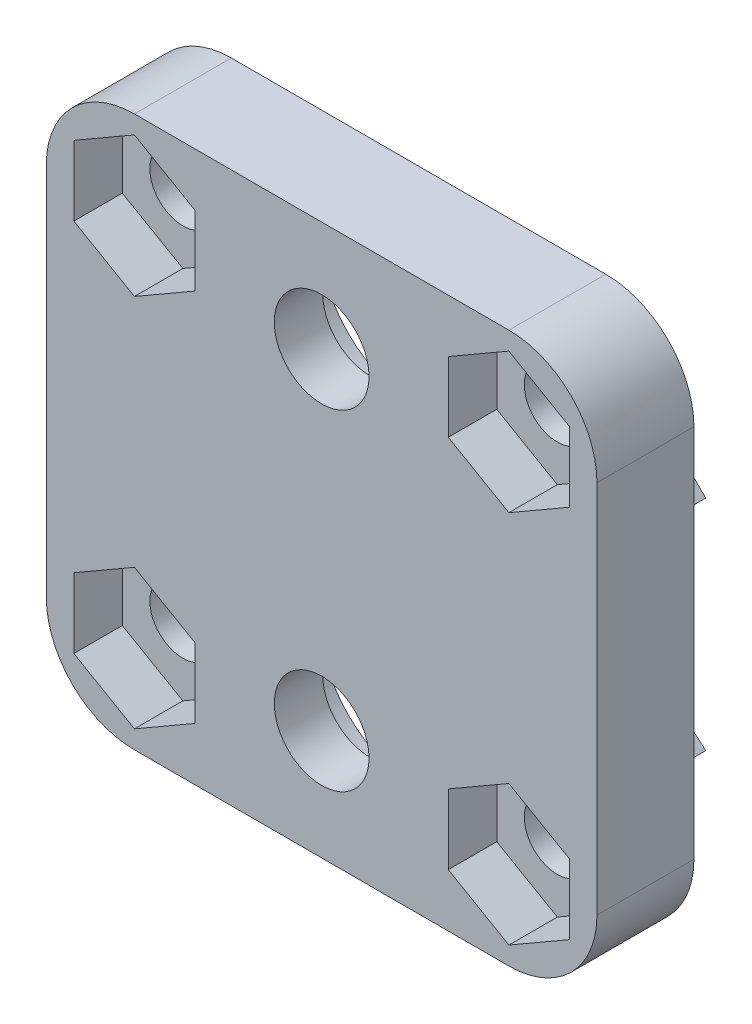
ISO-10303-21;
HEADER;
FILE_DESCRIPTION(('STEP AP214'),'2;1');
FILE_NAME('part.step','',(''),(''),'','','');
FILE_SCHEMA(('AUTOMOTIVE_DESIGN { 1 0 10303 214 1 1 1 1 }'));
ENDSEC;
DATA;
#1=APPLICATION_CONTEXT('core data for automotive mechanical design processes');
#2=APPLICATION_PROTOCOL_DEFINITION('international standard','automotive_design',2000,#1);
#3=PRODUCT_CONTEXT('',#1,'mechanical');
#4=PRODUCT('Part','Part','',(#3));
#5=PRODUCT_RELATED_PRODUCT_CATEGORY('part','',(#4));
#6=PRODUCT_DEFINITION_FORMATION('','',#4);
#7=PRODUCT_DEFINITION_CONTEXT('part definition',#1,'design');
#8=PRODUCT_DEFINITION('design','',#6,#7);
#9=PRODUCT_DEFINITION_SHAPE('','',#8);
#10=(LENGTH_UNIT() NAMED_UNIT(*) SI_UNIT(.MILLI.,.METRE.));
#11=(NAMED_UNIT(*) PLANE_ANGLE_UNIT() SI_UNIT($,.RADIAN.));
#12=(NAMED_UNIT(*) SI_UNIT($,.STERADIAN.) SOLID_ANGLE_UNIT());
#13=UNCERTAINTY_MEASURE_WITH_UNIT(LENGTH_MEASURE(1.E-05),#10,'distance_accuracy_value','');
#14=(GEOMETRIC_REPRESENTATION_CONTEXT(3) GLOBAL_UNCERTAINTY_ASSIGNED_CONTEXT((#13)) GLOBAL_UNIT_ASSIGNED_CONTEXT((#10,
#11,#12)) REPRESENTATION_CONTEXT('',''));
#15=CARTESIAN_POINT('',(0.,0.,0.));
#16=DIRECTION('',(0.,0.,1.));
#17=DIRECTION('',(1.,0.,0.));
#18=AXIS2_PLACEMENT_3D('',#15,#16,#17);
#19=CARTESIAN_POINT('',(17.,17.,-2.2));
#20=DIRECTION('',(0.,0.,1.));
#21=DIRECTION('',(1.,0.,0.));
#22=AXIS2_PLACEMENT_3D('',#19,#20,#21);
#23=PLANE('',#22);
#24=DIRECTION('',(-0.819152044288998,0.573576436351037,0.));
#25=VECTOR('',#24,1.);
#26=CARTESIAN_POINT('',(3.27660817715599,14.7056942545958,-2.2));
#27=LINE('',#26,#25);
#28=CARTESIAN_POINT('',(4.09576022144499,14.1321178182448,-2.2));
#29=VERTEX_POINT('',#28);
#30=CARTESIAN_POINT('',(3.27660817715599,14.7056942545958,-2.2));
#31=VERTEX_POINT('',#30);
#32=EDGE_CURVE('E382',#29,#31,#27,.T.);
#33=ORIENTED_EDGE('',*,*,#32,.T.);
#34=CARTESIAN_POINT('',(0.,17.,-2.2));
#35=DIRECTION('',(0.,0.,-1.));
#36=DIRECTION('',(1.,0.,0.));
#37=AXIS2_PLACEMENT_3D('',#34,#35,#36);
#38=CIRCLE('',#37,4.);
#39=CARTESIAN_POINT('',(-2.82842712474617,14.1715728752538,-2.2));
#40=VERTEX_POINT('',#39);
#41=EDGE_CURVE('E356',#31,#40,#38,.T.);
#42=ORIENTED_EDGE('',*,*,#41,.T.);
#43=DIRECTION('',(-0.707106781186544,-0.707106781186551,0.));
#44=VECTOR('',#43,1.);
#45=CARTESIAN_POINT('',(-2.82842712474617,14.1715728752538,-2.2));
#46=LINE('',#45,#44);
#47=CARTESIAN_POINT('',(-3.53553390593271,13.4644660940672,-2.2));
#48=VERTEX_POINT('',#47);
#49=EDGE_CURVE('E372',#40,#48,#46,.T.);
#50=ORIENTED_EDGE('',*,*,#49,.T.);
#51=CARTESIAN_POINT('',(0.,17.,-2.2));
#52=DIRECTION('',(0.,0.,1.));
#53=DIRECTION('',(1.,0.,0.));
#54=AXIS2_PLACEMENT_3D('',#51,#52,#53);
#55=CIRCLE('',#54,5.);
#56=EDGE_CURVE('E60',#48,#29,#55,.T.);
#57=ORIENTED_EDGE('',*,*,#56,.T.);
#58=EDGE_LOOP('',(#33,#42,#50,#57));
#59=FACE_BOUND('',#58,.T.);
#60=CARTESIAN_POINT('',(17.,17.,-2.2));
#61=DIRECTION('',(0.,0.,1.));
#62=DIRECTION('',(-1.,0.,0.));
#63=AXIS2_PLACEMENT_3D('',#60,#61,#62);
#64=CIRCLE('',#63,4.);
#65=CARTESIAN_POINT('',(13.723391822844,14.7056942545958,-2.2));
#66=VERTEX_POINT('',#65);
#67=CARTESIAN_POINT('',(19.8284271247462,14.1715728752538,-2.2));
#68=VERTEX_POINT('',#67);
#69=EDGE_CURVE('E453',#66,#68,#64,.T.);
#70=ORIENTED_EDGE('',*,*,#69,.F.);
#71=DIRECTION('',(0.819152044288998,0.573576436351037,0.));
#72=VECTOR('',#71,1.);
#73=CARTESIAN_POINT('',(13.723391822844,14.7056942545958,-2.2));
#74=LINE('',#73,#72);
#75=CARTESIAN_POINT('',(12.904239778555,14.1321178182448,-2.2));
#76=VERTEX_POINT('',#75);
#77=EDGE_CURVE('E458',#76,#66,#74,.T.);
#78=ORIENTED_EDGE('',*,*,#77,.F.);
#79=CARTESIAN_POINT('',(17.,17.,-2.2));
#80=DIRECTION('',(0.,0.,-1.));
#81=DIRECTION('',(-1.,0.,0.));
#82=AXIS2_PLACEMENT_3D('',#79,#80,#81);
#83=CIRCLE('',#82,5.);
#84=CARTESIAN_POINT('',(20.5355339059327,13.4644660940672,-2.2));
#85=VERTEX_POINT('',#84);
#86=EDGE_CURVE('E470',#85,#76,#83,.T.);
#87=ORIENTED_EDGE('',*,*,#86,.F.);
#88=DIRECTION('',(0.707106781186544,-0.707106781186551,0.));
#89=VECTOR('',#88,1.);
#90=CARTESIAN_POINT('',(19.8284271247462,14.1715728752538,-2.2));
#91=LINE('',#90,#89);
#92=EDGE_CURVE('E467',#68,#85,#91,.T.);
#93=ORIENTED_EDGE('',*,*,#92,.F.);
#94=EDGE_LOOP('',(#70,#78,#87,#93));
#95=FACE_BOUND('',#94,.T.);
#96=CARTESIAN_POINT('',(8.5,16.,-2.2));
#97=DIRECTION('',(0.,0.,-1.));
#98=DIRECTION('',(-1.,0.,0.));
#99=AXIS2_PLACEMENT_3D('',#96,#97,#98);
#100=CIRCLE('',#99,4.5);
#101=CARTESIAN_POINT('',(4.,16.,-2.2));
#102=VERTEX_POINT('',#101);
#103=EDGE_CURVE('E503',#102,#102,#100,.T.);
#104=ORIENTED_EDGE('',*,*,#103,.F.);
#105=EDGE_LOOP('',(#104));
#106=FACE_BOUND('',#105,.T.);
#107=CARTESIAN_POINT('',(8.49999999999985,1.,-2.2));
#108=DIRECTION('',(0.,0.,-1.));
#109=DIRECTION('',(-1.,0.,0.));
#110=AXIS2_PLACEMENT_3D('',#107,#108,#109);
#111=CIRCLE('',#110,4.5);
#112=CARTESIAN_POINT('',(3.99999999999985,1.,-2.2));
#113=VERTEX_POINT('',#112);
#114=EDGE_CURVE('E506',#113,#113,#111,.T.);
#115=ORIENTED_EDGE('',*,*,#114,.F.);
#116=EDGE_LOOP('',(#115));
#117=FACE_BOUND('',#116,.T.);
#118=CARTESIAN_POINT('',(17.,0.,-2.2));
#119=DIRECTION('',(0.,0.,1.));
#120=DIRECTION('',(1.,0.,0.));
#121=AXIS2_PLACEMENT_3D('',#118,#119,#120);
#122=CIRCLE('',#121,1.5);
#123=CARTESIAN_POINT('',(18.5,0.,-2.2));
#124=VERTEX_POINT('',#123);
#125=EDGE_CURVE('E511',#124,#124,#122,.T.);
#126=ORIENTED_EDGE('',*,*,#125,.T.);
#127=EDGE_LOOP('',(#126));
#128=FACE_BOUND('',#127,.T.);
#129=CARTESIAN_POINT('',(0.,17.,-2.2));
#130=DIRECTION('',(0.,0.,1.));
#131=DIRECTION('',(1.,0.,0.));
#132=AXIS2_PLACEMENT_3D('',#129,#130,#131);
#133=CIRCLE('',#132,1.5);
#134=CARTESIAN_POINT('',(1.5,17.,-2.2));
#135=VERTEX_POINT('',#134);
#136=EDGE_CURVE('E518',#135,#135,#133,.T.);
#137=ORIENTED_EDGE('',*,*,#136,.T.);
#138=EDGE_LOOP('',(#137));
#139=FACE_BOUND('',#138,.T.);
#140=CARTESIAN_POINT('',(0.,0.,-2.2));
#141=DIRECTION('',(0.,0.,1.));
#142=DIRECTION('',(1.,0.,0.));
#143=AXIS2_PLACEMENT_3D('',#140,#141,#142);
#144=CIRCLE('',#143,1.5);
#145=CARTESIAN_POINT('',(1.5,0.,-2.2));
#146=VERTEX_POINT('',#145);
#147=EDGE_CURVE('E524',#146,#146,#144,.T.);
#148=ORIENTED_EDGE('',*,*,#147,.T.);
#149=EDGE_LOOP('',(#148));
#150=FACE_BOUND('',#149,.T.);
#151=CARTESIAN_POINT('',(17.,17.,-2.2));
#152=DIRECTION('',(0.,0.,1.));
#153=DIRECTION('',(1.,0.,0.));
#154=AXIS2_PLACEMENT_3D('',#151,#152,#153);
#155=CIRCLE('',#154,1.5);
#156=CARTESIAN_POINT('',(18.5,17.,-2.2));
#157=VERTEX_POINT('',#156);
#158=EDGE_CURVE('E673',#157,#157,#155,.T.);
#159=ORIENTED_EDGE('',*,*,#158,.T.);
#160=EDGE_LOOP('',(#159));
#161=FACE_BOUND('',#160,.T.);
#162=CARTESIAN_POINT('',(17.,17.,-2.2));
#163=DIRECTION('',(0.,0.,1.));
#164=DIRECTION('',(1.,0.,0.));
#165=AXIS2_PLACEMENT_3D('',#162,#163,#164);
#166=CIRCLE('',#165,4.);
#167=CARTESIAN_POINT('',(21.,17.,-2.2));
#168=VERTEX_POINT('',#167);
#169=CARTESIAN_POINT('',(17.,21.,-2.2));
#170=VERTEX_POINT('',#169);
#171=EDGE_CURVE('E716',#168,#170,#166,.T.);
#172=ORIENTED_EDGE('',*,*,#171,.F.);
#173=DIRECTION('',(0.,1.,0.));
#174=VECTOR('',#173,1.);
#175=CARTESIAN_POINT('',(21.,17.,-2.2));
#176=LINE('',#175,#174);
#177=CARTESIAN_POINT('',(21.,0.,-2.2));
#178=VERTEX_POINT('',#177);
#179=EDGE_CURVE('E731',#178,#168,#176,.T.);
#180=ORIENTED_EDGE('',*,*,#179,.F.);
#181=CARTESIAN_POINT('',(17.,0.,-2.2));
#182=DIRECTION('',(0.,0.,1.));
#183=DIRECTION('',(1.,0.,0.));
#184=AXIS2_PLACEMENT_3D('',#181,#182,#183);
#185=CIRCLE('',#184,4.);
#186=CARTESIAN_POINT('',(17.,-4.,-2.2));
#187=VERTEX_POINT('',#186);
#188=EDGE_CURVE('E758',#187,#178,#185,.T.);
#189=ORIENTED_EDGE('',*,*,#188,.F.);
#190=DIRECTION('',(1.,0.,0.));
#191=VECTOR('',#190,1.);
#192=CARTESIAN_POINT('',(17.,-4.,-2.2));
#193=LINE('',#192,#191);
#194=CARTESIAN_POINT('',(0.,-4.,-2.2));
#195=VERTEX_POINT('',#194);
#196=EDGE_CURVE('E756',#195,#187,#193,.T.);
#197=ORIENTED_EDGE('',*,*,#196,.F.);
#198=CARTESIAN_POINT('',(0.,0.,-2.2));
#199=DIRECTION('',(0.,0.,1.));
#200=DIRECTION('',(1.,0.,0.));
#201=AXIS2_PLACEMENT_3D('',#198,#199,#200);
#202=CIRCLE('',#201,4.);
#203=CARTESIAN_POINT('',(-4.,0.,-2.2));
#204=VERTEX_POINT('',#203);
#205=EDGE_CURVE('E754',#204,#195,#202,.T.);
#206=ORIENTED_EDGE('',*,*,#205,.F.);
#207=DIRECTION('',(0.,-1.,0.));
#208=VECTOR('',#207,1.);
#209=CARTESIAN_POINT('',(-4.,17.,-2.2));
#210=LINE('',#209,#208);
#211=CARTESIAN_POINT('',(-4.,17.,-2.2));
#212=VERTEX_POINT('',#211);
#213=EDGE_CURVE('E752',#212,#204,#210,.T.);
#214=ORIENTED_EDGE('',*,*,#213,.F.);
#215=CARTESIAN_POINT('',(0.,17.,-2.2));
#216=DIRECTION('',(0.,0.,1.));
#217=DIRECTION('',(1.,0.,0.));
#218=AXIS2_PLACEMENT_3D('',#215,#216,#217);
#219=CIRCLE('',#218,4.);
#220=CARTESIAN_POINT('',(0.,21.,-2.2));
#221=VERTEX_POINT('',#220);
#222=EDGE_CURVE('E750',#221,#212,#219,.T.);
#223=ORIENTED_EDGE('',*,*,#222,.F.);
#224=DIRECTION('',(-1.,0.,0.));
#225=VECTOR('',#224,1.);
#226=CARTESIAN_POINT('',(17.,21.,-2.2));
#227=LINE('',#226,#225);
#228=EDGE_CURVE('E748',#170,#221,#227,.T.);
#229=ORIENTED_EDGE('',*,*,#228,.F.);
#230=EDGE_LOOP('',(#172,#180,#189,#197,#206,#214,#223,#229));
#231=FACE_BOUND('',#230,.T.);
#232=DIRECTION('',(0.819152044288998,-0.573576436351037,0.));
#233=VECTOR('',#232,1.);
#234=CARTESIAN_POINT('',(13.723391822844,2.29430574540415,-2.2));
#235=LINE('',#234,#233);
#236=CARTESIAN_POINT('',(12.904239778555,2.86788218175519,-2.2));
#237=VERTEX_POINT('',#236);
#238=CARTESIAN_POINT('',(13.723391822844,2.29430574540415,-2.2));
#239=VERTEX_POINT('',#238);
#240=EDGE_CURVE('E437',#237,#239,#235,.T.);
#241=ORIENTED_EDGE('',*,*,#240,.T.);
#242=CARTESIAN_POINT('',(17.,0.,-2.2));
#243=DIRECTION('',(0.,0.,-1.));
#244=DIRECTION('',(-1.,0.,0.));
#245=AXIS2_PLACEMENT_3D('',#242,#243,#244);
#246=CIRCLE('',#245,4.);
#247=CARTESIAN_POINT('',(19.8284271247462,2.82842712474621,-2.2));
#248=VERTEX_POINT('',#247);
#249=EDGE_CURVE('E420',#239,#248,#246,.T.);
#250=ORIENTED_EDGE('',*,*,#249,.T.);
#251=DIRECTION('',(0.707106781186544,0.707106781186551,0.));
#252=VECTOR('',#251,1.);
#253=CARTESIAN_POINT('',(19.8284271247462,2.82842712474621,-2.2));
#254=LINE('',#253,#252);
#255=CARTESIAN_POINT('',(20.5355339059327,3.53553390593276,-2.2));
#256=VERTEX_POINT('',#255);
#257=EDGE_CURVE('E425',#248,#256,#254,.T.);
#258=ORIENTED_EDGE('',*,*,#257,.T.);
#259=CARTESIAN_POINT('',(17.,0.,-2.2));
#260=DIRECTION('',(0.,0.,1.));
#261=DIRECTION('',(-1.,0.,0.));
#262=AXIS2_PLACEMENT_3D('',#259,#260,#261);
#263=CIRCLE('',#262,5.);
#264=EDGE_CURVE('E440',#256,#237,#263,.T.);
#265=ORIENTED_EDGE('',*,*,#264,.T.);
#266=EDGE_LOOP('',(#241,#250,#258,#265));
#267=FACE_BOUND('',#266,.T.);
#268=CARTESIAN_POINT('',(0.,0.,-2.2));
#269=DIRECTION('',(0.,0.,1.));
#270=DIRECTION('',(1.,0.,0.));
#271=AXIS2_PLACEMENT_3D('',#268,#269,#270);
#272=CIRCLE('',#271,4.);
#273=CARTESIAN_POINT('',(3.27660817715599,2.29430574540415,-2.2));
#274=VERTEX_POINT('',#273);
#275=CARTESIAN_POINT('',(-2.82842712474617,2.8284271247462,-2.2));
#276=VERTEX_POINT('',#275);
#277=EDGE_CURVE('E361',#274,#276,#272,.T.);
#278=ORIENTED_EDGE('',*,*,#277,.F.);
#279=DIRECTION('',(-0.819152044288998,-0.573576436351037,0.));
#280=VECTOR('',#279,1.);
#281=CARTESIAN_POINT('',(3.27660817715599,2.29430574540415,-2.2));
#282=LINE('',#281,#280);
#283=CARTESIAN_POINT('',(4.09576022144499,2.86788218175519,-2.2));
#284=VERTEX_POINT('',#283);
#285=EDGE_CURVE('E395',#284,#274,#282,.T.);
#286=ORIENTED_EDGE('',*,*,#285,.F.);
#287=CARTESIAN_POINT('',(0.,0.,-2.2));
#288=DIRECTION('',(0.,0.,-1.));
#289=DIRECTION('',(1.,0.,0.));
#290=AXIS2_PLACEMENT_3D('',#287,#288,#289);
#291=CIRCLE('',#290,5.);
#292=CARTESIAN_POINT('',(-3.53553390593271,3.53553390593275,-2.2));
#293=VERTEX_POINT('',#292);
#294=EDGE_CURVE('E405',#293,#284,#291,.T.);
#295=ORIENTED_EDGE('',*,*,#294,.F.);
#296=DIRECTION('',(-0.707106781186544,0.707106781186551,0.));
#297=VECTOR('',#296,1.);
#298=CARTESIAN_POINT('',(-2.82842712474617,2.8284271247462,-2.2));
#299=LINE('',#298,#297);
#300=EDGE_CURVE('E68',#276,#293,#299,.T.);
#301=ORIENTED_EDGE('',*,*,#300,.F.);
#302=EDGE_LOOP('',(#278,#286,#295,#301));
#303=FACE_BOUND('',#302,.T.);
#304=ADVANCED_FACE('F45',(#59,#95,#106,#117,#128,#139,#150,#161,#231,#267,#303),#23,.F.);
#305=CARTESIAN_POINT('',(17.,17.,2.2));
#306=DIRECTION('',(0.,0.,-1.));
#307=DIRECTION('',(-1.,0.,0.));
#308=AXIS2_PLACEMENT_3D('',#305,#306,#307);
#309=CYLINDRICAL_SURFACE('',#308,4.);
#310=ORIENTED_EDGE('',*,*,#171,.T.);
#311=DIRECTION('',(0.,0.,-1.));
#312=VECTOR('',#311,1.);
#313=CARTESIAN_POINT('',(17.,21.,2.2));
#314=LINE('',#313,#312);
#315=CARTESIAN_POINT('',(17.,21.,2.2));
#316=VERTEX_POINT('',#315);
#317=EDGE_CURVE('E11',#316,#170,#314,.T.);
#318=ORIENTED_EDGE('',*,*,#317,.F.);
#319=CARTESIAN_POINT('',(17.,17.,2.2));
#320=DIRECTION('',(0.,0.,1.));
#321=DIRECTION('',(1.,0.,0.));
#322=AXIS2_PLACEMENT_3D('',#319,#320,#321);
#323=CIRCLE('',#322,4.);
#324=CARTESIAN_POINT('',(21.,17.,2.2));
#325=VERTEX_POINT('',#324);
#326=EDGE_CURVE('E727',#325,#316,#323,.T.);
#327=ORIENTED_EDGE('',*,*,#326,.F.);
#328=DIRECTION('',(0.,0.,-1.));
#329=VECTOR('',#328,1.);
#330=CARTESIAN_POINT('',(21.,17.,2.2));
#331=LINE('',#330,#329);
#332=EDGE_CURVE('E745',#325,#168,#331,.T.);
#333=ORIENTED_EDGE('',*,*,#332,.T.);
#334=EDGE_LOOP('',(#310,#318,#327,#333));
#335=FACE_BOUND('',#334,.T.);
#336=ADVANCED_FACE('F47',(#335),#309,.T.);
#337=CARTESIAN_POINT('',(17.,21.,2.2));
#338=DIRECTION('',(0.,-1.,0.));
#339=DIRECTION('',(1.,0.,0.));
#340=AXIS2_PLACEMENT_3D('',#337,#338,#339);
#341=PLANE('',#340);
#342=ORIENTED_EDGE('',*,*,#228,.T.);
#343=DIRECTION('',(0.,0.,-1.));
#344=VECTOR('',#343,1.);
#345=CARTESIAN_POINT('',(0.,21.,2.2));
#346=LINE('',#345,#344);
#347=CARTESIAN_POINT('',(0.,21.,2.2));
#348=VERTEX_POINT('',#347);
#349=EDGE_CURVE('E53',#348,#221,#346,.T.);
#350=ORIENTED_EDGE('',*,*,#349,.F.);
#351=DIRECTION('',(-1.,0.,0.));
#352=VECTOR('',#351,1.);
#353=CARTESIAN_POINT('',(17.,21.,2.2));
#354=LINE('',#353,#352);
#355=EDGE_CURVE('E730',#316,#348,#354,.T.);
#356=ORIENTED_EDGE('',*,*,#355,.F.);
#357=ORIENTED_EDGE('',*,*,#317,.T.);
#358=EDGE_LOOP('',(#342,#350,#356,#357));
#359=FACE_BOUND('',#358,.T.);
#360=ADVANCED_FACE('F805',(#359),#341,.F.);
#361=CARTESIAN_POINT('',(0.,17.,2.2));
#362=DIRECTION('',(0.,0.,-1.));
#363=DIRECTION('',(-1.,0.,0.));
#364=AXIS2_PLACEMENT_3D('',#361,#362,#363);
#365=CYLINDRICAL_SURFACE('',#364,4.);
#366=ORIENTED_EDGE('',*,*,#222,.T.);
#367=DIRECTION('',(0.,0.,-1.));
#368=VECTOR('',#367,1.);
#369=CARTESIAN_POINT('',(-4.,17.,2.2));
#370=LINE('',#369,#368);
#371=CARTESIAN_POINT('',(-4.,17.,2.2));
#372=VERTEX_POINT('',#371);
#373=EDGE_CURVE('E775',#372,#212,#370,.T.);
#374=ORIENTED_EDGE('',*,*,#373,.F.);
#375=CARTESIAN_POINT('',(0.,17.,2.2));
#376=DIRECTION('',(0.,0.,1.));
#377=DIRECTION('',(1.,0.,0.));
#378=AXIS2_PLACEMENT_3D('',#375,#376,#377);
#379=CIRCLE('',#378,4.);
#380=EDGE_CURVE('E733',#348,#372,#379,.T.);
#381=ORIENTED_EDGE('',*,*,#380,.F.);
#382=ORIENTED_EDGE('',*,*,#349,.T.);
#383=EDGE_LOOP('',(#366,#374,#381,#382));
#384=FACE_BOUND('',#383,.T.);
#385=ADVANCED_FACE('F782',(#384),#365,.T.);
#386=CARTESIAN_POINT('',(-4.,17.,2.2));
#387=DIRECTION('',(1.,0.,0.));
#388=DIRECTION('',(0.,1.,0.));
#389=AXIS2_PLACEMENT_3D('',#386,#387,#388);
#390=PLANE('',#389);
#391=ORIENTED_EDGE('',*,*,#213,.T.);
#392=DIRECTION('',(0.,0.,-1.));
#393=VECTOR('',#392,1.);
#394=CARTESIAN_POINT('',(-4.,0.,2.2));
#395=LINE('',#394,#393);
#396=CARTESIAN_POINT('',(-4.,0.,2.2));
#397=VERTEX_POINT('',#396);
#398=EDGE_CURVE('E772',#397,#204,#395,.T.);
#399=ORIENTED_EDGE('',*,*,#398,.F.);
#400=DIRECTION('',(0.,-1.,0.));
#401=VECTOR('',#400,1.);
#402=CARTESIAN_POINT('',(-4.,17.,2.2));
#403=LINE('',#402,#401);
#404=EDGE_CURVE('E735',#372,#397,#403,.T.);
#405=ORIENTED_EDGE('',*,*,#404,.F.);
#406=ORIENTED_EDGE('',*,*,#373,.T.);
#407=EDGE_LOOP('',(#391,#399,#405,#406));
#408=FACE_BOUND('',#407,.T.);
#409=ADVANCED_FACE('F793',(#408),#390,.F.);
#410=CARTESIAN_POINT('',(0.,0.,2.2));
#411=DIRECTION('',(0.,0.,-1.));
#412=DIRECTION('',(-1.,0.,0.));
#413=AXIS2_PLACEMENT_3D('',#410,#411,#412);
#414=CYLINDRICAL_SURFACE('',#413,4.);
#415=ORIENTED_EDGE('',*,*,#205,.T.);
#416=DIRECTION('',(0.,0.,-1.));
#417=VECTOR('',#416,1.);
#418=CARTESIAN_POINT('',(0.,-4.,2.2));
#419=LINE('',#418,#417);
#420=CARTESIAN_POINT('',(0.,-4.,2.2));
#421=VERTEX_POINT('',#420);
#422=EDGE_CURVE('E769',#421,#195,#419,.T.);
#423=ORIENTED_EDGE('',*,*,#422,.F.);
#424=CARTESIAN_POINT('',(0.,0.,2.2));
#425=DIRECTION('',(0.,0.,1.));
#426=DIRECTION('',(1.,0.,0.));
#427=AXIS2_PLACEMENT_3D('',#424,#425,#426);
#428=CIRCLE('',#427,4.);
#429=EDGE_CURVE('E737',#397,#421,#428,.T.);
#430=ORIENTED_EDGE('',*,*,#429,.F.);
#431=ORIENTED_EDGE('',*,*,#398,.T.);
#432=EDGE_LOOP('',(#415,#423,#430,#431));
#433=FACE_BOUND('',#432,.T.);
#434=ADVANCED_FACE('F797',(#433),#414,.T.);
#435=CARTESIAN_POINT('',(17.,-4.,2.2));
#436=DIRECTION('',(0.,1.,0.));
#437=DIRECTION('',(-1.,0.,0.));
#438=AXIS2_PLACEMENT_3D('',#435,#436,#437);
#439=PLANE('',#438);
#440=ORIENTED_EDGE('',*,*,#196,.T.);
#441=DIRECTION('',(0.,0.,-1.));
#442=VECTOR('',#441,1.);
#443=CARTESIAN_POINT('',(17.,-4.,2.2));
#444=LINE('',#443,#442);
#445=CARTESIAN_POINT('',(17.,-4.,2.2));
#446=VERTEX_POINT('',#445);
#447=EDGE_CURVE('E766',#446,#187,#444,.T.);
#448=ORIENTED_EDGE('',*,*,#447,.F.);
#449=DIRECTION('',(1.,0.,0.));
#450=VECTOR('',#449,1.);
#451=CARTESIAN_POINT('',(17.,-4.,2.2));
#452=LINE('',#451,#450);
#453=EDGE_CURVE('E739',#421,#446,#452,.T.);
#454=ORIENTED_EDGE('',*,*,#453,.F.);
#455=ORIENTED_EDGE('',*,*,#422,.T.);
#456=EDGE_LOOP('',(#440,#448,#454,#455));
#457=FACE_BOUND('',#456,.T.);
#458=ADVANCED_FACE('F818',(#457),#439,.F.);
#459=CARTESIAN_POINT('',(17.,0.,2.2));
#460=DIRECTION('',(0.,0.,-1.));
#461=DIRECTION('',(-1.,0.,0.));
#462=AXIS2_PLACEMENT_3D('',#459,#460,#461);
#463=CYLINDRICAL_SURFACE('',#462,4.);
#464=ORIENTED_EDGE('',*,*,#188,.T.);
#465=DIRECTION('',(0.,0.,-1.));
#466=VECTOR('',#465,1.);
#467=CARTESIAN_POINT('',(21.,0.,2.2));
#468=LINE('',#467,#466);
#469=CARTESIAN_POINT('',(21.,0.,2.2));
#470=VERTEX_POINT('',#469);
#471=EDGE_CURVE('E763',#470,#178,#468,.T.);
#472=ORIENTED_EDGE('',*,*,#471,.F.);
#473=CARTESIAN_POINT('',(17.,0.,2.2));
#474=DIRECTION('',(0.,0.,1.));
#475=DIRECTION('',(1.,0.,0.));
#476=AXIS2_PLACEMENT_3D('',#473,#474,#475);
#477=CIRCLE('',#476,4.);
#478=EDGE_CURVE('E741',#446,#470,#477,.T.);
#479=ORIENTED_EDGE('',*,*,#478,.F.);
#480=ORIENTED_EDGE('',*,*,#447,.T.);
#481=EDGE_LOOP('',(#464,#472,#479,#480));
#482=FACE_BOUND('',#481,.T.);
#483=ADVANCED_FACE('F816',(#482),#463,.T.);
#484=CARTESIAN_POINT('',(21.,17.,2.2));
#485=DIRECTION('',(-1.,0.,0.));
#486=DIRECTION('',(0.,-1.,0.));
#487=AXIS2_PLACEMENT_3D('',#484,#485,#486);
#488=PLANE('',#487);
#489=ORIENTED_EDGE('',*,*,#179,.T.);
#490=ORIENTED_EDGE('',*,*,#332,.F.);
#491=DIRECTION('',(0.,1.,0.));
#492=VECTOR('',#491,1.);
#493=CARTESIAN_POINT('',(21.,17.,2.2));
#494=LINE('',#493,#492);
#495=EDGE_CURVE('E743',#470,#325,#494,.T.);
#496=ORIENTED_EDGE('',*,*,#495,.F.);
#497=ORIENTED_EDGE('',*,*,#471,.T.);
#498=EDGE_LOOP('',(#489,#490,#496,#497));
#499=FACE_BOUND('',#498,.T.);
#500=ADVANCED_FACE('F811',(#499),#488,.F.);
#501=CARTESIAN_POINT('',(17.,17.,2.2));
#502=DIRECTION('',(0.,0.,1.));
#503=DIRECTION('',(1.,0.,0.));
#504=AXIS2_PLACEMENT_3D('',#501,#502,#503);
#505=PLANE('',#504);
#506=CARTESIAN_POINT('',(8.5,16.,2.2));
#507=DIRECTION('',(0.,0.,-1.));
#508=DIRECTION('',(-1.,0.,0.));
#509=AXIS2_PLACEMENT_3D('',#506,#507,#508);
#510=CIRCLE('',#509,2.15);
#511=CARTESIAN_POINT('',(6.35,16.,2.2));
#512=VERTEX_POINT('',#511);
#513=EDGE_CURVE('E487',#512,#512,#510,.T.);
#514=ORIENTED_EDGE('',*,*,#513,.T.);
#515=EDGE_LOOP('',(#514));
#516=FACE_BOUND('',#515,.T.);
#517=CARTESIAN_POINT('',(8.49999999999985,1.,2.2));
#518=DIRECTION('',(0.,0.,-1.));
#519=DIRECTION('',(-1.,0.,0.));
#520=AXIS2_PLACEMENT_3D('',#517,#518,#519);
#521=CIRCLE('',#520,2.15);
#522=CARTESIAN_POINT('',(6.34999999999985,1.,2.2));
#523=VERTEX_POINT('',#522);
#524=EDGE_CURVE('E486',#523,#523,#521,.T.);
#525=ORIENTED_EDGE('',*,*,#524,.T.);
#526=EDGE_LOOP('',(#525));
#527=FACE_BOUND('',#526,.T.);
#528=DIRECTION('',(0.866025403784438,0.500000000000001,0.));
#529=VECTOR('',#528,1.);
#530=CARTESIAN_POINT('',(17.,-3.17542648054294,2.2));
#531=LINE('',#530,#529);
#532=CARTESIAN_POINT('',(17.,-3.17542648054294,2.2));
#533=VERTEX_POINT('',#532);
#534=CARTESIAN_POINT('',(19.75,-1.58771324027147,2.2));
#535=VERTEX_POINT('',#534);
#536=EDGE_CURVE('E549',#533,#535,#531,.T.);
#537=ORIENTED_EDGE('',*,*,#536,.F.);
#538=DIRECTION('',(0.866025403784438,-0.5,0.));
#539=VECTOR('',#538,1.);
#540=CARTESIAN_POINT('',(14.25,-1.58771324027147,2.2));
#541=LINE('',#540,#539);
#542=CARTESIAN_POINT('',(14.25,-1.58771324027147,2.2));
#543=VERTEX_POINT('',#542);
#544=EDGE_CURVE('E533',#543,#533,#541,.T.);
#545=ORIENTED_EDGE('',*,*,#544,.F.);
#546=DIRECTION('',(0.,-1.,0.));
#547=VECTOR('',#546,1.);
#548=CARTESIAN_POINT('',(14.25,1.58771324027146,2.2));
#549=LINE('',#548,#547);
#550=CARTESIAN_POINT('',(14.25,1.58771324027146,2.2));
#551=VERTEX_POINT('',#550);
#552=EDGE_CURVE('E561',#551,#543,#549,.T.);
#553=ORIENTED_EDGE('',*,*,#552,.F.);
#554=DIRECTION('',(-0.866025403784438,-0.5,0.));
#555=VECTOR('',#554,1.);
#556=CARTESIAN_POINT('',(17.,3.17542648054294,2.2));
#557=LINE('',#556,#555);
#558=CARTESIAN_POINT('',(17.,3.17542648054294,2.2));
#559=VERTEX_POINT('',#558);
#560=EDGE_CURVE('E558',#559,#551,#557,.T.);
#561=ORIENTED_EDGE('',*,*,#560,.F.);
#562=DIRECTION('',(-0.866025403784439,0.5,0.));
#563=VECTOR('',#562,1.);
#564=CARTESIAN_POINT('',(19.75,1.58771324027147,2.2));
#565=LINE('',#564,#563);
#566=CARTESIAN_POINT('',(19.75,1.58771324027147,2.2));
#567=VERTEX_POINT('',#566);
#568=EDGE_CURVE('E555',#567,#559,#565,.T.);
#569=ORIENTED_EDGE('',*,*,#568,.F.);
#570=DIRECTION('',(0.,1.,0.));
#571=VECTOR('',#570,1.);
#572=CARTESIAN_POINT('',(19.75,-1.58771324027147,2.2));
#573=LINE('',#572,#571);
#574=EDGE_CURVE('E551',#535,#567,#573,.T.);
#575=ORIENTED_EDGE('',*,*,#574,.F.);
#576=EDGE_LOOP('',(#537,#545,#553,#561,#569,#575));
#577=FACE_BOUND('',#576,.T.);
#578=DIRECTION('',(0.866025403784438,0.500000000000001,0.));
#579=VECTOR('',#578,1.);
#580=CARTESIAN_POINT('',(0.,13.8245735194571,2.2));
#581=LINE('',#580,#579);
#582=CARTESIAN_POINT('',(0.,13.8245735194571,2.2));
#583=VERTEX_POINT('',#582);
#584=CARTESIAN_POINT('',(2.75,15.4122867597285,2.2));
#585=VERTEX_POINT('',#584);
#586=EDGE_CURVE('E599',#583,#585,#581,.T.);
#587=ORIENTED_EDGE('',*,*,#586,.F.);
#588=DIRECTION('',(0.866025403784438,-0.5,0.));
#589=VECTOR('',#588,1.);
#590=CARTESIAN_POINT('',(-2.75,15.4122867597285,2.2));
#591=LINE('',#590,#589);
#592=CARTESIAN_POINT('',(-2.75,15.4122867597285,2.2));
#593=VERTEX_POINT('',#592);
#594=EDGE_CURVE('E583',#593,#583,#591,.T.);
#595=ORIENTED_EDGE('',*,*,#594,.F.);
#596=DIRECTION('',(0.,-1.,0.));
#597=VECTOR('',#596,1.);
#598=CARTESIAN_POINT('',(-2.75,18.5877132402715,2.2));
#599=LINE('',#598,#597);
#600=CARTESIAN_POINT('',(-2.75,18.5877132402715,2.2));
#601=VERTEX_POINT('',#600);
#602=EDGE_CURVE('E611',#601,#593,#599,.T.);
#603=ORIENTED_EDGE('',*,*,#602,.F.);
#604=DIRECTION('',(-0.866025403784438,-0.5,0.));
#605=VECTOR('',#604,1.);
#606=CARTESIAN_POINT('',(0.,20.1754264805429,2.2));
#607=LINE('',#606,#605);
#608=CARTESIAN_POINT('',(0.,20.1754264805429,2.2));
#609=VERTEX_POINT('',#608);
#610=EDGE_CURVE('E608',#609,#601,#607,.T.);
#611=ORIENTED_EDGE('',*,*,#610,.F.);
#612=DIRECTION('',(-0.866025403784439,0.5,0.));
#613=VECTOR('',#612,1.);
#614=CARTESIAN_POINT('',(2.75,18.5877132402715,2.2));
#615=LINE('',#614,#613);
#616=CARTESIAN_POINT('',(2.75,18.5877132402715,2.2));
#617=VERTEX_POINT('',#616);
#618=EDGE_CURVE('E605',#617,#609,#615,.T.);
#619=ORIENTED_EDGE('',*,*,#618,.F.);
#620=DIRECTION('',(0.,1.,0.));
#621=VECTOR('',#620,1.);
#622=CARTESIAN_POINT('',(2.75,15.4122867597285,2.2));
#623=LINE('',#622,#621);
#624=EDGE_CURVE('E601',#585,#617,#623,.T.);
#625=ORIENTED_EDGE('',*,*,#624,.F.);
#626=EDGE_LOOP('',(#587,#595,#603,#611,#619,#625));
#627=FACE_BOUND('',#626,.T.);
#628=DIRECTION('',(0.866025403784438,0.500000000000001,0.));
#629=VECTOR('',#628,1.);
#630=CARTESIAN_POINT('',(0.,-3.17542648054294,2.2));
#631=LINE('',#630,#629);
#632=CARTESIAN_POINT('',(0.,-3.17542648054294,2.2));
#633=VERTEX_POINT('',#632);
#634=CARTESIAN_POINT('',(2.75,-1.58771324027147,2.2));
#635=VERTEX_POINT('',#634);
#636=EDGE_CURVE('E514',#633,#635,#631,.T.);
#637=ORIENTED_EDGE('',*,*,#636,.F.);
#638=DIRECTION('',(0.866025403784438,-0.5,0.));
#639=VECTOR('',#638,1.);
#640=CARTESIAN_POINT('',(-2.75,-1.58771324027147,2.2));
#641=LINE('',#640,#639);
#642=CARTESIAN_POINT('',(-2.75,-1.58771324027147,2.2));
#643=VERTEX_POINT('',#642);
#644=EDGE_CURVE('E631',#643,#633,#641,.T.);
#645=ORIENTED_EDGE('',*,*,#644,.F.);
#646=DIRECTION('',(0.,-1.,0.));
#647=VECTOR('',#646,1.);
#648=CARTESIAN_POINT('',(-2.75,1.58771324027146,2.2));
#649=LINE('',#648,#647);
#650=CARTESIAN_POINT('',(-2.75,1.58771324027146,2.2));
#651=VERTEX_POINT('',#650);
#652=EDGE_CURVE('E657',#651,#643,#649,.T.);
#653=ORIENTED_EDGE('',*,*,#652,.F.);
#654=DIRECTION('',(-0.866025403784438,-0.5,0.));
#655=VECTOR('',#654,1.);
#656=CARTESIAN_POINT('',(0.,3.17542648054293,2.2));
#657=LINE('',#656,#655);
#658=CARTESIAN_POINT('',(0.,3.17542648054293,2.2));
#659=VERTEX_POINT('',#658);
#660=EDGE_CURVE('E654',#659,#651,#657,.T.);
#661=ORIENTED_EDGE('',*,*,#660,.F.);
#662=DIRECTION('',(-0.866025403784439,0.5,0.));
#663=VECTOR('',#662,1.);
#664=CARTESIAN_POINT('',(2.75,1.58771324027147,2.2));
#665=LINE('',#664,#663);
#666=CARTESIAN_POINT('',(2.75,1.58771324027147,2.2));
#667=VERTEX_POINT('',#666);
#668=EDGE_CURVE('E651',#667,#659,#665,.T.);
#669=ORIENTED_EDGE('',*,*,#668,.F.);
#670=DIRECTION('',(0.,1.,0.));
#671=VECTOR('',#670,1.);
#672=CARTESIAN_POINT('',(2.75,-1.58771324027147,2.2));
#673=LINE('',#672,#671);
#674=EDGE_CURVE('E648',#635,#667,#673,.T.);
#675=ORIENTED_EDGE('',*,*,#674,.F.);
#676=EDGE_LOOP('',(#637,#645,#653,#661,#669,#675));
#677=FACE_BOUND('',#676,.T.);
#678=DIRECTION('',(0.866025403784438,0.500000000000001,0.));
#679=VECTOR('',#678,1.);
#680=CARTESIAN_POINT('',(17.,13.8245735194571,2.2));
#681=LINE('',#680,#679);
#682=CARTESIAN_POINT('',(17.,13.8245735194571,2.2));
#683=VERTEX_POINT('',#682);
#684=CARTESIAN_POINT('',(19.75,15.4122867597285,2.2));
#685=VERTEX_POINT('',#684);
#686=EDGE_CURVE('E676',#683,#685,#681,.T.);
#687=ORIENTED_EDGE('',*,*,#686,.F.);
#688=DIRECTION('',(0.866025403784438,-0.5,0.));
#689=VECTOR('',#688,1.);
#690=CARTESIAN_POINT('',(14.25,15.4122867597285,2.2));
#691=LINE('',#690,#689);
#692=CARTESIAN_POINT('',(14.25,15.4122867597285,2.2));
#693=VERTEX_POINT('',#692);
#694=EDGE_CURVE('E683',#693,#683,#691,.T.);
#695=ORIENTED_EDGE('',*,*,#694,.F.);
#696=DIRECTION('',(0.,-1.,0.));
#697=VECTOR('',#696,1.);
#698=CARTESIAN_POINT('',(14.25,18.5877132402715,2.2));
#699=LINE('',#698,#697);
#700=CARTESIAN_POINT('',(14.25,18.5877132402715,2.2));
#701=VERTEX_POINT('',#700);
#702=EDGE_CURVE('E709',#701,#693,#699,.T.);
#703=ORIENTED_EDGE('',*,*,#702,.F.);
#704=DIRECTION('',(-0.866025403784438,-0.5,0.));
#705=VECTOR('',#704,1.);
#706=CARTESIAN_POINT('',(17.,20.1754264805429,2.2));
#707=LINE('',#706,#705);
#708=CARTESIAN_POINT('',(17.,20.1754264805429,2.2));
#709=VERTEX_POINT('',#708);
#710=EDGE_CURVE('E706',#709,#701,#707,.T.);
#711=ORIENTED_EDGE('',*,*,#710,.F.);
#712=DIRECTION('',(-0.866025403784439,0.5,0.));
#713=VECTOR('',#712,1.);
#714=CARTESIAN_POINT('',(19.75,18.5877132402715,2.2));
#715=LINE('',#714,#713);
#716=CARTESIAN_POINT('',(19.75,18.5877132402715,2.2));
#717=VERTEX_POINT('',#716);
#718=EDGE_CURVE('E703',#717,#709,#715,.T.);
#719=ORIENTED_EDGE('',*,*,#718,.F.);
#720=DIRECTION('',(0.,1.,0.));
#721=VECTOR('',#720,1.);
#722=CARTESIAN_POINT('',(19.75,15.4122867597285,2.2));
#723=LINE('',#722,#721);
#724=EDGE_CURVE('E700',#685,#717,#723,.T.);
#725=ORIENTED_EDGE('',*,*,#724,.F.);
#726=EDGE_LOOP('',(#687,#695,#703,#711,#719,#725));
#727=FACE_BOUND('',#726,.T.);
#728=ORIENTED_EDGE('',*,*,#326,.T.);
#729=ORIENTED_EDGE('',*,*,#355,.T.);
#730=ORIENTED_EDGE('',*,*,#380,.T.);
#731=ORIENTED_EDGE('',*,*,#404,.T.);
#732=ORIENTED_EDGE('',*,*,#429,.T.);
#733=ORIENTED_EDGE('',*,*,#453,.T.);
#734=ORIENTED_EDGE('',*,*,#478,.T.);
#735=ORIENTED_EDGE('',*,*,#495,.T.);
#736=EDGE_LOOP('',(#728,#729,#730,#731,#732,#733,#734,#735));
#737=FACE_BOUND('',#736,.T.);
#738=ADVANCED_FACE('F801',(#516,#527,#577,#627,#677,#727,#737),#505,.T.);
#739=CARTESIAN_POINT('',(17.,13.8245735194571,0.));
#740=DIRECTION('',(0.500000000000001,-0.866025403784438,0.));
#741=DIRECTION('',(0.866025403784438,0.500000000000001,0.));
#742=AXIS2_PLACEMENT_3D('',#739,#740,#741);
#743=PLANE('',#742);
#744=ORIENTED_EDGE('',*,*,#686,.T.);
#745=DIRECTION('',(0.,0.,1.));
#746=VECTOR('',#745,1.);
#747=CARTESIAN_POINT('',(19.75,15.4122867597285,0.));
#748=LINE('',#747,#746);
#749=CARTESIAN_POINT('',(19.75,15.4122867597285,0.));
#750=VERTEX_POINT('',#749);
#751=EDGE_CURVE('E698',#750,#685,#748,.T.);
#752=ORIENTED_EDGE('',*,*,#751,.F.);
#753=DIRECTION('',(0.866025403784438,0.500000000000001,0.));
#754=VECTOR('',#753,1.);
#755=CARTESIAN_POINT('',(17.,13.8245735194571,0.));
#756=LINE('',#755,#754);
#757=CARTESIAN_POINT('',(17.,13.8245735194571,0.));
#758=VERTEX_POINT('',#757);
#759=EDGE_CURVE('E679',#758,#750,#756,.T.);
#760=ORIENTED_EDGE('',*,*,#759,.F.);
#761=DIRECTION('',(0.,0.,1.));
#762=VECTOR('',#761,1.);
#763=CARTESIAN_POINT('',(17.,13.8245735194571,0.));
#764=LINE('',#763,#762);
#765=EDGE_CURVE('E714',#758,#683,#764,.T.);
#766=ORIENTED_EDGE('',*,*,#765,.T.);
#767=EDGE_LOOP('',(#744,#752,#760,#766));
#768=FACE_BOUND('',#767,.T.);
#769=ADVANCED_FACE('F844',(#768),#743,.F.);
#770=CARTESIAN_POINT('',(14.25,15.4122867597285,0.));
#771=DIRECTION('',(-0.5,-0.866025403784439,0.));
#772=DIRECTION('',(0.866025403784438,-0.5,0.));
#773=AXIS2_PLACEMENT_3D('',#770,#771,#772);
#774=PLANE('',#773);
#775=ORIENTED_EDGE('',*,*,#694,.T.);
#776=ORIENTED_EDGE('',*,*,#765,.F.);
#777=DIRECTION('',(0.866025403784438,-0.5,0.));
#778=VECTOR('',#777,1.);
#779=CARTESIAN_POINT('',(14.25,15.4122867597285,0.));
#780=LINE('',#779,#778);
#781=CARTESIAN_POINT('',(14.25,15.4122867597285,0.));
#782=VERTEX_POINT('',#781);
#783=EDGE_CURVE('E695',#782,#758,#780,.T.);
#784=ORIENTED_EDGE('',*,*,#783,.F.);
#785=DIRECTION('',(0.,0.,1.));
#786=VECTOR('',#785,1.);
#787=CARTESIAN_POINT('',(14.25,15.4122867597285,0.));
#788=LINE('',#787,#786);
#789=EDGE_CURVE('E717',#782,#693,#788,.T.);
#790=ORIENTED_EDGE('',*,*,#789,.T.);
#791=EDGE_LOOP('',(#775,#776,#784,#790));
#792=FACE_BOUND('',#791,.T.);
#793=ADVANCED_FACE('F850',(#792),#774,.F.);
#794=CARTESIAN_POINT('',(14.25,18.5877132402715,0.));
#795=DIRECTION('',(-1.,0.,0.));
#796=DIRECTION('',(0.,-1.,0.));
#797=AXIS2_PLACEMENT_3D('',#794,#795,#796);
#798=PLANE('',#797);
#799=ORIENTED_EDGE('',*,*,#702,.T.);
#800=ORIENTED_EDGE('',*,*,#789,.F.);
#801=DIRECTION('',(0.,-1.,0.));
#802=VECTOR('',#801,1.);
#803=CARTESIAN_POINT('',(14.25,18.5877132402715,0.));
#804=LINE('',#803,#802);
#805=CARTESIAN_POINT('',(14.25,18.5877132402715,0.));
#806=VERTEX_POINT('',#805);
#807=EDGE_CURVE('E692',#806,#782,#804,.T.);
#808=ORIENTED_EDGE('',*,*,#807,.F.);
#809=DIRECTION('',(0.,0.,1.));
#810=VECTOR('',#809,1.);
#811=CARTESIAN_POINT('',(14.25,18.5877132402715,0.));
#812=LINE('',#811,#810);
#813=EDGE_CURVE('E719',#806,#701,#812,.T.);
#814=ORIENTED_EDGE('',*,*,#813,.T.);
#815=EDGE_LOOP('',(#799,#800,#808,#814));
#816=FACE_BOUND('',#815,.T.);
#817=ADVANCED_FACE('F884',(#816),#798,.F.);
#818=CARTESIAN_POINT('',(17.,20.1754264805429,0.));
#819=DIRECTION('',(-0.5,0.866025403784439,0.));
#820=DIRECTION('',(-0.866025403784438,-0.5,0.));
#821=AXIS2_PLACEMENT_3D('',#818,#819,#820);
#822=PLANE('',#821);
#823=ORIENTED_EDGE('',*,*,#710,.T.);
#824=ORIENTED_EDGE('',*,*,#813,.F.);
#825=DIRECTION('',(-0.866025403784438,-0.5,0.));
#826=VECTOR('',#825,1.);
#827=CARTESIAN_POINT('',(17.,20.1754264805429,0.));
#828=LINE('',#827,#826);
#829=CARTESIAN_POINT('',(17.,20.1754264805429,0.));
#830=VERTEX_POINT('',#829);
#831=EDGE_CURVE('E689',#830,#806,#828,.T.);
#832=ORIENTED_EDGE('',*,*,#831,.F.);
#833=DIRECTION('',(0.,0.,1.));
#834=VECTOR('',#833,1.);
#835=CARTESIAN_POINT('',(17.,20.1754264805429,0.));
#836=LINE('',#835,#834);
#837=EDGE_CURVE('E721',#830,#709,#836,.T.);
#838=ORIENTED_EDGE('',*,*,#837,.T.);
#839=EDGE_LOOP('',(#823,#824,#832,#838));
#840=FACE_BOUND('',#839,.T.);
#841=ADVANCED_FACE('F887',(#840),#822,.F.);
#842=CARTESIAN_POINT('',(19.75,18.5877132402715,0.));
#843=DIRECTION('',(0.5,0.866025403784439,0.));
#844=DIRECTION('',(-0.866025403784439,0.5,0.));
#845=AXIS2_PLACEMENT_3D('',#842,#843,#844);
#846=PLANE('',#845);
#847=ORIENTED_EDGE('',*,*,#718,.T.);
#848=ORIENTED_EDGE('',*,*,#837,.F.);
#849=DIRECTION('',(-0.866025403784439,0.5,0.));
#850=VECTOR('',#849,1.);
#851=CARTESIAN_POINT('',(19.75,18.5877132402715,0.));
#852=LINE('',#851,#850);
#853=CARTESIAN_POINT('',(19.75,18.5877132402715,0.));
#854=VERTEX_POINT('',#853);
#855=EDGE_CURVE('E686',#854,#830,#852,.T.);
#856=ORIENTED_EDGE('',*,*,#855,.F.);
#857=DIRECTION('',(0.,0.,1.));
#858=VECTOR('',#857,1.);
#859=CARTESIAN_POINT('',(19.75,18.5877132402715,0.));
#860=LINE('',#859,#858);
#861=EDGE_CURVE('E723',#854,#717,#860,.T.);
#862=ORIENTED_EDGE('',*,*,#861,.T.);
#863=EDGE_LOOP('',(#847,#848,#856,#862));
#864=FACE_BOUND('',#863,.T.);
#865=ADVANCED_FACE('F890',(#864),#846,.F.);
#866=CARTESIAN_POINT('',(19.75,15.4122867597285,0.));
#867=DIRECTION('',(1.,0.,0.));
#868=DIRECTION('',(0.,0.,-1.));
#869=AXIS2_PLACEMENT_3D('',#866,#867,#868);
#870=PLANE('',#869);
#871=ORIENTED_EDGE('',*,*,#724,.T.);
#872=ORIENTED_EDGE('',*,*,#861,.F.);
#873=DIRECTION('',(0.,1.,0.));
#874=VECTOR('',#873,1.);
#875=CARTESIAN_POINT('',(19.75,15.4122867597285,0.));
#876=LINE('',#875,#874);
#877=EDGE_CURVE('E682',#750,#854,#876,.T.);
#878=ORIENTED_EDGE('',*,*,#877,.F.);
#879=ORIENTED_EDGE('',*,*,#751,.T.);
#880=EDGE_LOOP('',(#871,#872,#878,#879));
#881=FACE_BOUND('',#880,.T.);
#882=ADVANCED_FACE('F876',(#881),#870,.F.);
#883=CARTESIAN_POINT('',(0.,0.,0.));
#884=DIRECTION('',(0.,0.,1.));
#885=DIRECTION('',(1.,0.,0.));
#886=AXIS2_PLACEMENT_3D('',#883,#884,#885);
#887=PLANE('',#886);
#888=CARTESIAN_POINT('',(17.,17.,0.));
#889=DIRECTION('',(0.,0.,1.));
#890=DIRECTION('',(1.,0.,0.));
#891=AXIS2_PLACEMENT_3D('',#888,#889,#890);
#892=CIRCLE('',#891,1.5);
#893=CARTESIAN_POINT('',(18.5,17.,0.));
#894=VERTEX_POINT('',#893);
#895=EDGE_CURVE('E568',#894,#894,#892,.T.);
#896=ORIENTED_EDGE('',*,*,#895,.F.);
#897=EDGE_LOOP('',(#896));
#898=FACE_BOUND('',#897,.T.);
#899=ORIENTED_EDGE('',*,*,#759,.T.);
#900=ORIENTED_EDGE('',*,*,#877,.T.);
#901=ORIENTED_EDGE('',*,*,#855,.T.);
#902=ORIENTED_EDGE('',*,*,#831,.T.);
#903=ORIENTED_EDGE('',*,*,#807,.T.);
#904=ORIENTED_EDGE('',*,*,#783,.T.);
#905=EDGE_LOOP('',(#899,#900,#901,#902,#903,#904));
#906=FACE_BOUND('',#905,.T.);
#907=ADVANCED_FACE('F879',(#898,#906),#887,.T.);
#908=CARTESIAN_POINT('',(17.,17.,-2.2));
#909=DIRECTION('',(0.,0.,1.));
#910=DIRECTION('',(1.,0.,0.));
#911=AXIS2_PLACEMENT_3D('',#908,#909,#910);
#912=CYLINDRICAL_SURFACE('',#911,1.5);
#913=ORIENTED_EDGE('',*,*,#158,.F.);
#914=EDGE_LOOP('',(#913));
#915=FACE_BOUND('',#914,.T.);
#916=ORIENTED_EDGE('',*,*,#895,.T.);
#917=EDGE_LOOP('',(#916));
#918=FACE_BOUND('',#917,.T.);
#919=ADVANCED_FACE('F906',(#915,#918),#912,.F.);
#920=CARTESIAN_POINT('',(0.,-3.17542648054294,0.));
#921=DIRECTION('',(0.500000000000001,-0.866025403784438,0.));
#922=DIRECTION('',(0.866025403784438,0.500000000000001,0.));
#923=AXIS2_PLACEMENT_3D('',#920,#921,#922);
#924=PLANE('',#923);
#925=ORIENTED_EDGE('',*,*,#636,.T.);
#926=DIRECTION('',(0.,0.,1.));
#927=VECTOR('',#926,1.);
#928=CARTESIAN_POINT('',(2.75,-1.58771324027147,0.));
#929=LINE('',#928,#927);
#930=CARTESIAN_POINT('',(2.75,-1.58771324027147,0.));
#931=VERTEX_POINT('',#930);
#932=EDGE_CURVE('E646',#931,#635,#929,.T.);
#933=ORIENTED_EDGE('',*,*,#932,.F.);
#934=DIRECTION('',(0.866025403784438,0.500000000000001,0.));
#935=VECTOR('',#934,1.);
#936=CARTESIAN_POINT('',(0.,-3.17542648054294,0.));
#937=LINE('',#936,#935);
#938=CARTESIAN_POINT('',(0.,-3.17542648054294,0.));
#939=VERTEX_POINT('',#938);
#940=EDGE_CURVE('E627',#939,#931,#937,.T.);
#941=ORIENTED_EDGE('',*,*,#940,.F.);
#942=DIRECTION('',(0.,0.,1.));
#943=VECTOR('',#942,1.);
#944=CARTESIAN_POINT('',(0.,-3.17542648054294,0.));
#945=LINE('',#944,#943);
#946=EDGE_CURVE('E602',#939,#633,#945,.T.);
#947=ORIENTED_EDGE('',*,*,#946,.T.);
#948=EDGE_LOOP('',(#925,#933,#941,#947));
#949=FACE_BOUND('',#948,.T.);
#950=ADVANCED_FACE('F910',(#949),#924,.F.);
#951=CARTESIAN_POINT('',(-2.75,-1.58771324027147,0.));
#952=DIRECTION('',(-0.5,-0.866025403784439,0.));
#953=DIRECTION('',(0.866025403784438,-0.5,0.));
#954=AXIS2_PLACEMENT_3D('',#951,#952,#953);
#955=PLANE('',#954);
#956=ORIENTED_EDGE('',*,*,#644,.T.);
#957=ORIENTED_EDGE('',*,*,#946,.F.);
#958=DIRECTION('',(0.866025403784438,-0.5,0.));
#959=VECTOR('',#958,1.);
#960=CARTESIAN_POINT('',(-2.75,-1.58771324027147,0.));
#961=LINE('',#960,#959);
#962=CARTESIAN_POINT('',(-2.75,-1.58771324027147,0.));
#963=VERTEX_POINT('',#962);
#964=EDGE_CURVE('E643',#963,#939,#961,.T.);
#965=ORIENTED_EDGE('',*,*,#964,.F.);
#966=DIRECTION('',(0.,0.,1.));
#967=VECTOR('',#966,1.);
#968=CARTESIAN_POINT('',(-2.75,-1.58771324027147,0.));
#969=LINE('',#968,#967);
#970=EDGE_CURVE('E663',#963,#643,#969,.T.);
#971=ORIENTED_EDGE('',*,*,#970,.T.);
#972=EDGE_LOOP('',(#956,#957,#965,#971));
#973=FACE_BOUND('',#972,.T.);
#974=ADVANCED_FACE('F914',(#973),#955,.F.);
#975=CARTESIAN_POINT('',(-2.75,1.58771324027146,0.));
#976=DIRECTION('',(-1.,0.,0.));
#977=DIRECTION('',(0.,-1.,0.));
#978=AXIS2_PLACEMENT_3D('',#975,#976,#977);
#979=PLANE('',#978);
#980=ORIENTED_EDGE('',*,*,#652,.T.);
#981=ORIENTED_EDGE('',*,*,#970,.F.);
#982=DIRECTION('',(0.,-1.,0.));
#983=VECTOR('',#982,1.);
#984=CARTESIAN_POINT('',(-2.75,1.58771324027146,0.));
#985=LINE('',#984,#983);
#986=CARTESIAN_POINT('',(-2.75,1.58771324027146,0.));
#987=VERTEX_POINT('',#986);
#988=EDGE_CURVE('E640',#987,#963,#985,.T.);
#989=ORIENTED_EDGE('',*,*,#988,.F.);
#990=DIRECTION('',(0.,0.,1.));
#991=VECTOR('',#990,1.);
#992=CARTESIAN_POINT('',(-2.75,1.58771324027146,0.));
#993=LINE('',#992,#991);
#994=EDGE_CURVE('E665',#987,#651,#993,.T.);
#995=ORIENTED_EDGE('',*,*,#994,.T.);
#996=EDGE_LOOP('',(#980,#981,#989,#995));
#997=FACE_BOUND('',#996,.T.);
#998=ADVANCED_FACE('F928',(#997),#979,.F.);
#999=CARTESIAN_POINT('',(0.,3.17542648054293,0.));
#1000=DIRECTION('',(-0.5,0.866025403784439,0.));
#1001=DIRECTION('',(-0.866025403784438,-0.5,0.));
#1002=AXIS2_PLACEMENT_3D('',#999,#1000,#1001);
#1003=PLANE('',#1002);
#1004=ORIENTED_EDGE('',*,*,#660,.T.);
#1005=ORIENTED_EDGE('',*,*,#994,.F.);
#1006=DIRECTION('',(-0.866025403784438,-0.5,0.));
#1007=VECTOR('',#1006,1.);
#1008=CARTESIAN_POINT('',(0.,3.17542648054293,0.));
#1009=LINE('',#1008,#1007);
#1010=CARTESIAN_POINT('',(0.,3.17542648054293,0.));
#1011=VERTEX_POINT('',#1010);
#1012=EDGE_CURVE('E637',#1011,#987,#1009,.T.);
#1013=ORIENTED_EDGE('',*,*,#1012,.F.);
#1014=DIRECTION('',(0.,0.,1.));
#1015=VECTOR('',#1014,1.);
#1016=CARTESIAN_POINT('',(0.,3.17542648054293,0.));
#1017=LINE('',#1016,#1015);
#1018=EDGE_CURVE('E667',#1011,#659,#1017,.T.);
#1019=ORIENTED_EDGE('',*,*,#1018,.T.);
#1020=EDGE_LOOP('',(#1004,#1005,#1013,#1019));
#1021=FACE_BOUND('',#1020,.T.);
#1022=ADVANCED_FACE('F924',(#1021),#1003,.F.);
#1023=CARTESIAN_POINT('',(2.75,1.58771324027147,0.));
#1024=DIRECTION('',(0.5,0.866025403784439,0.));
#1025=DIRECTION('',(-0.866025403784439,0.5,0.));
#1026=AXIS2_PLACEMENT_3D('',#1023,#1024,#1025);
#1027=PLANE('',#1026);
#1028=ORIENTED_EDGE('',*,*,#668,.T.);
#1029=ORIENTED_EDGE('',*,*,#1018,.F.);
#1030=DIRECTION('',(-0.866025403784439,0.5,0.));
#1031=VECTOR('',#1030,1.);
#1032=CARTESIAN_POINT('',(2.75,1.58771324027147,0.));
#1033=LINE('',#1032,#1031);
#1034=CARTESIAN_POINT('',(2.75,1.58771324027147,0.));
#1035=VERTEX_POINT('',#1034);
#1036=EDGE_CURVE('E634',#1035,#1011,#1033,.T.);
#1037=ORIENTED_EDGE('',*,*,#1036,.F.);
#1038=DIRECTION('',(0.,0.,1.));
#1039=VECTOR('',#1038,1.);
#1040=CARTESIAN_POINT('',(2.75,1.58771324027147,0.));
#1041=LINE('',#1040,#1039);
#1042=EDGE_CURVE('E669',#1035,#667,#1041,.T.);
#1043=ORIENTED_EDGE('',*,*,#1042,.T.);
#1044=EDGE_LOOP('',(#1028,#1029,#1037,#1043));
#1045=FACE_BOUND('',#1044,.T.);
#1046=ADVANCED_FACE('F920',(#1045),#1027,.F.);
#1047=CARTESIAN_POINT('',(2.75,-1.58771324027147,0.));
#1048=DIRECTION('',(1.,0.,0.));
#1049=DIRECTION('',(0.,0.,-1.));
#1050=AXIS2_PLACEMENT_3D('',#1047,#1048,#1049);
#1051=PLANE('',#1050);
#1052=ORIENTED_EDGE('',*,*,#674,.T.);
#1053=ORIENTED_EDGE('',*,*,#1042,.F.);
#1054=DIRECTION('',(0.,1.,0.));
#1055=VECTOR('',#1054,1.);
#1056=CARTESIAN_POINT('',(2.75,-1.58771324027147,0.));
#1057=LINE('',#1056,#1055);
#1058=EDGE_CURVE('E630',#931,#1035,#1057,.T.);
#1059=ORIENTED_EDGE('',*,*,#1058,.F.);
#1060=ORIENTED_EDGE('',*,*,#932,.T.);
#1061=EDGE_LOOP('',(#1052,#1053,#1059,#1060));
#1062=FACE_BOUND('',#1061,.T.);
#1063=ADVANCED_FACE('F916',(#1062),#1051,.F.);
#1064=CARTESIAN_POINT('',(-17.,-17.,0.));
#1065=DIRECTION('',(0.,0.,1.));
#1066=DIRECTION('',(1.,0.,0.));
#1067=AXIS2_PLACEMENT_3D('',#1064,#1065,#1066);
#1068=PLANE('',#1067);
#1069=CARTESIAN_POINT('',(0.,0.,0.));
#1070=DIRECTION('',(0.,0.,1.));
#1071=DIRECTION('',(1.,0.,0.));
#1072=AXIS2_PLACEMENT_3D('',#1069,#1070,#1071);
#1073=CIRCLE('',#1072,1.5);
#1074=CARTESIAN_POINT('',(1.5,0.,0.));
#1075=VERTEX_POINT('',#1074);
#1076=EDGE_CURVE('E502',#1075,#1075,#1073,.T.);
#1077=ORIENTED_EDGE('',*,*,#1076,.F.);
#1078=EDGE_LOOP('',(#1077));
#1079=FACE_BOUND('',#1078,.T.);
#1080=ORIENTED_EDGE('',*,*,#940,.T.);
#1081=ORIENTED_EDGE('',*,*,#1058,.T.);
#1082=ORIENTED_EDGE('',*,*,#1036,.T.);
#1083=ORIENTED_EDGE('',*,*,#1012,.T.);
#1084=ORIENTED_EDGE('',*,*,#988,.T.);
#1085=ORIENTED_EDGE('',*,*,#964,.T.);
#1086=EDGE_LOOP('',(#1080,#1081,#1082,#1083,#1084,#1085));
#1087=FACE_BOUND('',#1086,.T.);
#1088=ADVANCED_FACE('F919',(#1079,#1087),#1068,.T.);
#1089=CARTESIAN_POINT('',(0.,13.8245735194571,0.));
#1090=DIRECTION('',(0.500000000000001,-0.866025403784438,0.));
#1091=DIRECTION('',(0.866025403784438,0.500000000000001,0.));
#1092=AXIS2_PLACEMENT_3D('',#1089,#1090,#1091);
#1093=PLANE('',#1092);
#1094=ORIENTED_EDGE('',*,*,#586,.T.);
#1095=DIRECTION('',(0.,0.,1.));
#1096=VECTOR('',#1095,1.);
#1097=CARTESIAN_POINT('',(2.75,15.4122867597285,0.));
#1098=LINE('',#1097,#1096);
#1099=CARTESIAN_POINT('',(2.75,15.4122867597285,0.));
#1100=VERTEX_POINT('',#1099);
#1101=EDGE_CURVE('E598',#1100,#585,#1098,.T.);
#1102=ORIENTED_EDGE('',*,*,#1101,.F.);
#1103=DIRECTION('',(0.866025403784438,0.500000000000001,0.));
#1104=VECTOR('',#1103,1.);
#1105=CARTESIAN_POINT('',(0.,13.8245735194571,0.));
#1106=LINE('',#1105,#1104);
#1107=CARTESIAN_POINT('',(0.,13.8245735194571,0.));
#1108=VERTEX_POINT('',#1107);
#1109=EDGE_CURVE('E579',#1108,#1100,#1106,.T.);
#1110=ORIENTED_EDGE('',*,*,#1109,.F.);
#1111=DIRECTION('',(0.,0.,1.));
#1112=VECTOR('',#1111,1.);
#1113=CARTESIAN_POINT('',(0.,13.8245735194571,0.));
#1114=LINE('',#1113,#1112);
#1115=EDGE_CURVE('E552',#1108,#583,#1114,.T.);
#1116=ORIENTED_EDGE('',*,*,#1115,.T.);
#1117=EDGE_LOOP('',(#1094,#1102,#1110,#1116));
#1118=FACE_BOUND('',#1117,.T.);
#1119=ADVANCED_FACE('F938',(#1118),#1093,.F.);
#1120=CARTESIAN_POINT('',(-2.75,15.4122867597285,0.));
#1121=DIRECTION('',(-0.5,-0.866025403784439,0.));
#1122=DIRECTION('',(0.866025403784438,-0.5,0.));
#1123=AXIS2_PLACEMENT_3D('',#1120,#1121,#1122);
#1124=PLANE('',#1123);
#1125=ORIENTED_EDGE('',*,*,#594,.T.);
#1126=ORIENTED_EDGE('',*,*,#1115,.F.);
#1127=DIRECTION('',(0.866025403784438,-0.5,0.));
#1128=VECTOR('',#1127,1.);
#1129=CARTESIAN_POINT('',(-2.75,15.4122867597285,0.));
#1130=LINE('',#1129,#1128);
#1131=CARTESIAN_POINT('',(-2.75,15.4122867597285,0.));
#1132=VERTEX_POINT('',#1131);
#1133=EDGE_CURVE('E595',#1132,#1108,#1130,.T.);
#1134=ORIENTED_EDGE('',*,*,#1133,.F.);
#1135=DIRECTION('',(0.,0.,1.));
#1136=VECTOR('',#1135,1.);
#1137=CARTESIAN_POINT('',(-2.75,15.4122867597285,0.));
#1138=LINE('',#1137,#1136);
#1139=EDGE_CURVE('E617',#1132,#593,#1138,.T.);
#1140=ORIENTED_EDGE('',*,*,#1139,.T.);
#1141=EDGE_LOOP('',(#1125,#1126,#1134,#1140));
#1142=FACE_BOUND('',#1141,.T.);
#1143=ADVANCED_FACE('F942',(#1142),#1124,.F.);
#1144=CARTESIAN_POINT('',(-2.75,18.5877132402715,0.));
#1145=DIRECTION('',(-1.,0.,0.));
#1146=DIRECTION('',(0.,-1.,0.));
#1147=AXIS2_PLACEMENT_3D('',#1144,#1145,#1146);
#1148=PLANE('',#1147);
#1149=ORIENTED_EDGE('',*,*,#602,.T.);
#1150=ORIENTED_EDGE('',*,*,#1139,.F.);
#1151=DIRECTION('',(0.,-1.,0.));
#1152=VECTOR('',#1151,1.);
#1153=CARTESIAN_POINT('',(-2.75,18.5877132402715,0.));
#1154=LINE('',#1153,#1152);
#1155=CARTESIAN_POINT('',(-2.75,18.5877132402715,0.));
#1156=VERTEX_POINT('',#1155);
#1157=EDGE_CURVE('E592',#1156,#1132,#1154,.T.);
#1158=ORIENTED_EDGE('',*,*,#1157,.F.);
#1159=DIRECTION('',(0.,0.,1.));
#1160=VECTOR('',#1159,1.);
#1161=CARTESIAN_POINT('',(-2.75,18.5877132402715,0.));
#1162=LINE('',#1161,#1160);
#1163=EDGE_CURVE('E619',#1156,#601,#1162,.T.);
#1164=ORIENTED_EDGE('',*,*,#1163,.T.);
#1165=EDGE_LOOP('',(#1149,#1150,#1158,#1164));
#1166=FACE_BOUND('',#1165,.T.);
#1167=ADVANCED_FACE('F956',(#1166),#1148,.F.);
#1168=CARTESIAN_POINT('',(0.,20.1754264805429,0.));
#1169=DIRECTION('',(-0.5,0.866025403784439,0.));
#1170=DIRECTION('',(-0.866025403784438,-0.5,0.));
#1171=AXIS2_PLACEMENT_3D('',#1168,#1169,#1170);
#1172=PLANE('',#1171);
#1173=ORIENTED_EDGE('',*,*,#610,.T.);
#1174=ORIENTED_EDGE('',*,*,#1163,.F.);
#1175=DIRECTION('',(-0.866025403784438,-0.5,0.));
#1176=VECTOR('',#1175,1.);
#1177=CARTESIAN_POINT('',(0.,20.1754264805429,0.));
#1178=LINE('',#1177,#1176);
#1179=CARTESIAN_POINT('',(0.,20.1754264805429,0.));
#1180=VERTEX_POINT('',#1179);
#1181=EDGE_CURVE('E589',#1180,#1156,#1178,.T.);
#1182=ORIENTED_EDGE('',*,*,#1181,.F.);
#1183=DIRECTION('',(0.,0.,1.));
#1184=VECTOR('',#1183,1.);
#1185=CARTESIAN_POINT('',(0.,20.1754264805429,0.));
#1186=LINE('',#1185,#1184);
#1187=EDGE_CURVE('E621',#1180,#609,#1186,.T.);
#1188=ORIENTED_EDGE('',*,*,#1187,.T.);
#1189=EDGE_LOOP('',(#1173,#1174,#1182,#1188));
#1190=FACE_BOUND('',#1189,.T.);
#1191=ADVANCED_FACE('F952',(#1190),#1172,.F.);
#1192=CARTESIAN_POINT('',(2.75,18.5877132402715,0.));
#1193=DIRECTION('',(0.5,0.866025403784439,0.));
#1194=DIRECTION('',(-0.866025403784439,0.5,0.));
#1195=AXIS2_PLACEMENT_3D('',#1192,#1193,#1194);
#1196=PLANE('',#1195);
#1197=ORIENTED_EDGE('',*,*,#618,.T.);
#1198=ORIENTED_EDGE('',*,*,#1187,.F.);
#1199=DIRECTION('',(-0.866025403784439,0.5,0.));
#1200=VECTOR('',#1199,1.);
#1201=CARTESIAN_POINT('',(2.75,18.5877132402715,0.));
#1202=LINE('',#1201,#1200);
#1203=CARTESIAN_POINT('',(2.75,18.5877132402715,0.));
#1204=VERTEX_POINT('',#1203);
#1205=EDGE_CURVE('E586',#1204,#1180,#1202,.T.);
#1206=ORIENTED_EDGE('',*,*,#1205,.F.);
#1207=DIRECTION('',(0.,0.,1.));
#1208=VECTOR('',#1207,1.);
#1209=CARTESIAN_POINT('',(2.75,18.5877132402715,0.));
#1210=LINE('',#1209,#1208);
#1211=EDGE_CURVE('E623',#1204,#617,#1210,.T.);
#1212=ORIENTED_EDGE('',*,*,#1211,.T.);
#1213=EDGE_LOOP('',(#1197,#1198,#1206,#1212));
#1214=FACE_BOUND('',#1213,.T.);
#1215=ADVANCED_FACE('F948',(#1214),#1196,.F.);
#1216=CARTESIAN_POINT('',(2.75,15.4122867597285,0.));
#1217=DIRECTION('',(1.,0.,0.));
#1218=DIRECTION('',(0.,0.,-1.));
#1219=AXIS2_PLACEMENT_3D('',#1216,#1217,#1218);
#1220=PLANE('',#1219);
#1221=ORIENTED_EDGE('',*,*,#624,.T.);
#1222=ORIENTED_EDGE('',*,*,#1211,.F.);
#1223=DIRECTION('',(0.,1.,0.));
#1224=VECTOR('',#1223,1.);
#1225=CARTESIAN_POINT('',(2.75,15.4122867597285,0.));
#1226=LINE('',#1225,#1224);
#1227=EDGE_CURVE('E582',#1100,#1204,#1226,.T.);
#1228=ORIENTED_EDGE('',*,*,#1227,.F.);
#1229=ORIENTED_EDGE('',*,*,#1101,.T.);
#1230=EDGE_LOOP('',(#1221,#1222,#1228,#1229));
#1231=FACE_BOUND('',#1230,.T.);
#1232=ADVANCED_FACE('F944',(#1231),#1220,.F.);
#1233=CARTESIAN_POINT('',(-17.,0.,0.));
#1234=DIRECTION('',(0.,0.,1.));
#1235=DIRECTION('',(1.,0.,0.));
#1236=AXIS2_PLACEMENT_3D('',#1233,#1234,#1235);
#1237=PLANE('',#1236);
#1238=CARTESIAN_POINT('',(0.,17.,0.));
#1239=DIRECTION('',(0.,0.,1.));
#1240=DIRECTION('',(1.,0.,0.));
#1241=AXIS2_PLACEMENT_3D('',#1238,#1239,#1240);
#1242=CIRCLE('',#1241,1.5);
#1243=CARTESIAN_POINT('',(1.5,17.,0.));
#1244=VERTEX_POINT('',#1243);
#1245=EDGE_CURVE('E521',#1244,#1244,#1242,.T.);
#1246=ORIENTED_EDGE('',*,*,#1245,.F.);
#1247=EDGE_LOOP('',(#1246));
#1248=FACE_BOUND('',#1247,.T.);
#1249=ORIENTED_EDGE('',*,*,#1109,.T.);
#1250=ORIENTED_EDGE('',*,*,#1227,.T.);
#1251=ORIENTED_EDGE('',*,*,#1205,.T.);
#1252=ORIENTED_EDGE('',*,*,#1181,.T.);
#1253=ORIENTED_EDGE('',*,*,#1157,.T.);
#1254=ORIENTED_EDGE('',*,*,#1133,.T.);
#1255=EDGE_LOOP('',(#1249,#1250,#1251,#1252,#1253,#1254));
#1256=FACE_BOUND('',#1255,.T.);
#1257=ADVANCED_FACE('F947',(#1248,#1256),#1237,.T.);
#1258=CARTESIAN_POINT('',(17.,-3.17542648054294,0.));
#1259=DIRECTION('',(0.500000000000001,-0.866025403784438,0.));
#1260=DIRECTION('',(0.866025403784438,0.500000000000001,0.));
#1261=AXIS2_PLACEMENT_3D('',#1258,#1259,#1260);
#1262=PLANE('',#1261);
#1263=ORIENTED_EDGE('',*,*,#536,.T.);
#1264=DIRECTION('',(0.,0.,1.));
#1265=VECTOR('',#1264,1.);
#1266=CARTESIAN_POINT('',(19.75,-1.58771324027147,0.));
#1267=LINE('',#1266,#1265);
#1268=CARTESIAN_POINT('',(19.75,-1.58771324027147,0.));
#1269=VERTEX_POINT('',#1268);
#1270=EDGE_CURVE('E548',#1269,#535,#1267,.T.);
#1271=ORIENTED_EDGE('',*,*,#1270,.F.);
#1272=DIRECTION('',(0.866025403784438,0.500000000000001,0.));
#1273=VECTOR('',#1272,1.);
#1274=CARTESIAN_POINT('',(17.,-3.17542648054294,0.));
#1275=LINE('',#1274,#1273);
#1276=CARTESIAN_POINT('',(17.,-3.17542648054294,0.));
#1277=VERTEX_POINT('',#1276);
#1278=EDGE_CURVE('E529',#1277,#1269,#1275,.T.);
#1279=ORIENTED_EDGE('',*,*,#1278,.F.);
#1280=DIRECTION('',(0.,0.,1.));
#1281=VECTOR('',#1280,1.);
#1282=CARTESIAN_POINT('',(17.,-3.17542648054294,0.));
#1283=LINE('',#1282,#1281);
#1284=EDGE_CURVE('E566',#1277,#533,#1283,.T.);
#1285=ORIENTED_EDGE('',*,*,#1284,.T.);
#1286=EDGE_LOOP('',(#1263,#1271,#1279,#1285));
#1287=FACE_BOUND('',#1286,.T.);
#1288=ADVANCED_FACE('F966',(#1287),#1262,.F.);
#1289=CARTESIAN_POINT('',(14.25,-1.58771324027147,0.));
#1290=DIRECTION('',(-0.5,-0.866025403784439,0.));
#1291=DIRECTION('',(0.866025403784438,-0.5,0.));
#1292=AXIS2_PLACEMENT_3D('',#1289,#1290,#1291);
#1293=PLANE('',#1292);
#1294=ORIENTED_EDGE('',*,*,#544,.T.);
#1295=ORIENTED_EDGE('',*,*,#1284,.F.);
#1296=DIRECTION('',(0.866025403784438,-0.5,0.));
#1297=VECTOR('',#1296,1.);
#1298=CARTESIAN_POINT('',(14.25,-1.58771324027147,0.));
#1299=LINE('',#1298,#1297);
#1300=CARTESIAN_POINT('',(14.25,-1.58771324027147,0.));
#1301=VERTEX_POINT('',#1300);
#1302=EDGE_CURVE('E545',#1301,#1277,#1299,.T.);
#1303=ORIENTED_EDGE('',*,*,#1302,.F.);
#1304=DIRECTION('',(0.,0.,1.));
#1305=VECTOR('',#1304,1.);
#1306=CARTESIAN_POINT('',(14.25,-1.58771324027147,0.));
#1307=LINE('',#1306,#1305);
#1308=EDGE_CURVE('E569',#1301,#543,#1307,.T.);
#1309=ORIENTED_EDGE('',*,*,#1308,.T.);
#1310=EDGE_LOOP('',(#1294,#1295,#1303,#1309));
#1311=FACE_BOUND('',#1310,.T.);
#1312=ADVANCED_FACE('F970',(#1311),#1293,.F.);
#1313=CARTESIAN_POINT('',(14.25,1.58771324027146,0.));
#1314=DIRECTION('',(-1.,0.,0.));
#1315=DIRECTION('',(0.,-1.,0.));
#1316=AXIS2_PLACEMENT_3D('',#1313,#1314,#1315);
#1317=PLANE('',#1316);
#1318=ORIENTED_EDGE('',*,*,#552,.T.);
#1319=ORIENTED_EDGE('',*,*,#1308,.F.);
#1320=DIRECTION('',(0.,-1.,0.));
#1321=VECTOR('',#1320,1.);
#1322=CARTESIAN_POINT('',(14.25,1.58771324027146,0.));
#1323=LINE('',#1322,#1321);
#1324=CARTESIAN_POINT('',(14.25,1.58771324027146,0.));
#1325=VERTEX_POINT('',#1324);
#1326=EDGE_CURVE('E542',#1325,#1301,#1323,.T.);
#1327=ORIENTED_EDGE('',*,*,#1326,.F.);
#1328=DIRECTION('',(0.,0.,1.));
#1329=VECTOR('',#1328,1.);
#1330=CARTESIAN_POINT('',(14.25,1.58771324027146,0.));
#1331=LINE('',#1330,#1329);
#1332=EDGE_CURVE('E571',#1325,#551,#1331,.T.);
#1333=ORIENTED_EDGE('',*,*,#1332,.T.);
#1334=EDGE_LOOP('',(#1318,#1319,#1327,#1333));
#1335=FACE_BOUND('',#1334,.T.);
#1336=ADVANCED_FACE('F984',(#1335),#1317,.F.);
#1337=CARTESIAN_POINT('',(17.,3.17542648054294,0.));
#1338=DIRECTION('',(-0.5,0.866025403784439,0.));
#1339=DIRECTION('',(-0.866025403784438,-0.5,0.));
#1340=AXIS2_PLACEMENT_3D('',#1337,#1338,#1339);
#1341=PLANE('',#1340);
#1342=ORIENTED_EDGE('',*,*,#560,.T.);
#1343=ORIENTED_EDGE('',*,*,#1332,.F.);
#1344=DIRECTION('',(-0.866025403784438,-0.5,0.));
#1345=VECTOR('',#1344,1.);
#1346=CARTESIAN_POINT('',(17.,3.17542648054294,0.));
#1347=LINE('',#1346,#1345);
#1348=CARTESIAN_POINT('',(17.,3.17542648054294,0.));
#1349=VERTEX_POINT('',#1348);
#1350=EDGE_CURVE('E539',#1349,#1325,#1347,.T.);
#1351=ORIENTED_EDGE('',*,*,#1350,.F.);
#1352=DIRECTION('',(0.,0.,1.));
#1353=VECTOR('',#1352,1.);
#1354=CARTESIAN_POINT('',(17.,3.17542648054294,0.));
#1355=LINE('',#1354,#1353);
#1356=EDGE_CURVE('E573',#1349,#559,#1355,.T.);
#1357=ORIENTED_EDGE('',*,*,#1356,.T.);
#1358=EDGE_LOOP('',(#1342,#1343,#1351,#1357));
#1359=FACE_BOUND('',#1358,.T.);
#1360=ADVANCED_FACE('F980',(#1359),#1341,.F.);
#1361=CARTESIAN_POINT('',(19.75,1.58771324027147,0.));
#1362=DIRECTION('',(0.5,0.866025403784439,0.));
#1363=DIRECTION('',(-0.866025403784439,0.5,0.));
#1364=AXIS2_PLACEMENT_3D('',#1361,#1362,#1363);
#1365=PLANE('',#1364);
#1366=ORIENTED_EDGE('',*,*,#568,.T.);
#1367=ORIENTED_EDGE('',*,*,#1356,.F.);
#1368=DIRECTION('',(-0.866025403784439,0.5,0.));
#1369=VECTOR('',#1368,1.);
#1370=CARTESIAN_POINT('',(19.75,1.58771324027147,0.));
#1371=LINE('',#1370,#1369);
#1372=CARTESIAN_POINT('',(19.75,1.58771324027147,0.));
#1373=VERTEX_POINT('',#1372);
#1374=EDGE_CURVE('E536',#1373,#1349,#1371,.T.);
#1375=ORIENTED_EDGE('',*,*,#1374,.F.);
#1376=DIRECTION('',(0.,0.,1.));
#1377=VECTOR('',#1376,1.);
#1378=CARTESIAN_POINT('',(19.75,1.58771324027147,0.));
#1379=LINE('',#1378,#1377);
#1380=EDGE_CURVE('E575',#1373,#567,#1379,.T.);
#1381=ORIENTED_EDGE('',*,*,#1380,.T.);
#1382=EDGE_LOOP('',(#1366,#1367,#1375,#1381));
#1383=FACE_BOUND('',#1382,.T.);
#1384=ADVANCED_FACE('F976',(#1383),#1365,.F.);
#1385=CARTESIAN_POINT('',(19.75,-1.58771324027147,0.));
#1386=DIRECTION('',(1.,0.,0.));
#1387=DIRECTION('',(0.,0.,-1.));
#1388=AXIS2_PLACEMENT_3D('',#1385,#1386,#1387);
#1389=PLANE('',#1388);
#1390=ORIENTED_EDGE('',*,*,#574,.T.);
#1391=ORIENTED_EDGE('',*,*,#1380,.F.);
#1392=DIRECTION('',(0.,1.,0.));
#1393=VECTOR('',#1392,1.);
#1394=CARTESIAN_POINT('',(19.75,-1.58771324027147,0.));
#1395=LINE('',#1394,#1393);
#1396=EDGE_CURVE('E532',#1269,#1373,#1395,.T.);
#1397=ORIENTED_EDGE('',*,*,#1396,.F.);
#1398=ORIENTED_EDGE('',*,*,#1270,.T.);
#1399=EDGE_LOOP('',(#1390,#1391,#1397,#1398));
#1400=FACE_BOUND('',#1399,.T.);
#1401=ADVANCED_FACE('F972',(#1400),#1389,.F.);
#1402=CARTESIAN_POINT('',(0.,-17.,0.));
#1403=DIRECTION('',(0.,0.,1.));
#1404=DIRECTION('',(1.,0.,0.));
#1405=AXIS2_PLACEMENT_3D('',#1402,#1403,#1404);
#1406=PLANE('',#1405);
#1407=CARTESIAN_POINT('',(17.,0.,0.));
#1408=DIRECTION('',(0.,0.,1.));
#1409=DIRECTION('',(1.,0.,0.));
#1410=AXIS2_PLACEMENT_3D('',#1407,#1408,#1409);
#1411=CIRCLE('',#1410,1.5);
#1412=CARTESIAN_POINT('',(18.5,0.,0.));
#1413=VERTEX_POINT('',#1412);
#1414=EDGE_CURVE('E515',#1413,#1413,#1411,.T.);
#1415=ORIENTED_EDGE('',*,*,#1414,.F.);
#1416=EDGE_LOOP('',(#1415));
#1417=FACE_BOUND('',#1416,.T.);
#1418=ORIENTED_EDGE('',*,*,#1278,.T.);
#1419=ORIENTED_EDGE('',*,*,#1396,.T.);
#1420=ORIENTED_EDGE('',*,*,#1374,.T.);
#1421=ORIENTED_EDGE('',*,*,#1350,.T.);
#1422=ORIENTED_EDGE('',*,*,#1326,.T.);
#1423=ORIENTED_EDGE('',*,*,#1302,.T.);
#1424=EDGE_LOOP('',(#1418,#1419,#1420,#1421,#1422,#1423));
#1425=FACE_BOUND('',#1424,.T.);
#1426=ADVANCED_FACE('F975',(#1417,#1425),#1406,.T.);
#1427=CARTESIAN_POINT('',(0.,0.,-2.2));
#1428=DIRECTION('',(0.,0.,1.));
#1429=DIRECTION('',(1.,0.,0.));
#1430=AXIS2_PLACEMENT_3D('',#1427,#1428,#1429);
#1431=CYLINDRICAL_SURFACE('',#1430,1.5);
#1432=ORIENTED_EDGE('',*,*,#147,.F.);
#1433=EDGE_LOOP('',(#1432));
#1434=FACE_BOUND('',#1433,.T.);
#1435=ORIENTED_EDGE('',*,*,#1076,.T.);
#1436=EDGE_LOOP('',(#1435));
#1437=FACE_BOUND('',#1436,.T.);
#1438=ADVANCED_FACE('F994',(#1434,#1437),#1431,.F.);
#1439=CARTESIAN_POINT('',(0.,17.,-2.2));
#1440=DIRECTION('',(0.,0.,1.));
#1441=DIRECTION('',(1.,0.,0.));
#1442=AXIS2_PLACEMENT_3D('',#1439,#1440,#1441);
#1443=CYLINDRICAL_SURFACE('',#1442,1.5);
#1444=ORIENTED_EDGE('',*,*,#136,.F.);
#1445=EDGE_LOOP('',(#1444));
#1446=FACE_BOUND('',#1445,.T.);
#1447=ORIENTED_EDGE('',*,*,#1245,.T.);
#1448=EDGE_LOOP('',(#1447));
#1449=FACE_BOUND('',#1448,.T.);
#1450=ADVANCED_FACE('F998',(#1446,#1449),#1443,.F.);
#1451=CARTESIAN_POINT('',(17.,0.,-2.2));
#1452=DIRECTION('',(0.,0.,1.));
#1453=DIRECTION('',(1.,0.,0.));
#1454=AXIS2_PLACEMENT_3D('',#1451,#1452,#1453);
#1455=CYLINDRICAL_SURFACE('',#1454,1.5);
#1456=ORIENTED_EDGE('',*,*,#125,.F.);
#1457=EDGE_LOOP('',(#1456));
#1458=FACE_BOUND('',#1457,.T.);
#1459=ORIENTED_EDGE('',*,*,#1414,.T.);
#1460=EDGE_LOOP('',(#1459));
#1461=FACE_BOUND('',#1460,.T.);
#1462=ADVANCED_FACE('F1002',(#1458,#1461),#1455,.F.);
#1463=CARTESIAN_POINT('',(8.49999999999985,1.,0.));
#1464=DIRECTION('',(0.,0.,-1.));
#1465=DIRECTION('',(-1.,0.,0.));
#1466=AXIS2_PLACEMENT_3D('',#1463,#1464,#1465);
#1467=CYLINDRICAL_SURFACE('',#1466,4.5);
#1468=CARTESIAN_POINT('',(8.49999999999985,1.,0.));
#1469=DIRECTION('',(0.,0.,-1.));
#1470=DIRECTION('',(-1.,0.,0.));
#1471=AXIS2_PLACEMENT_3D('',#1468,#1469,#1470);
#1472=CIRCLE('',#1471,4.5);
#1473=CARTESIAN_POINT('',(3.99999999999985,1.,0.));
#1474=VERTEX_POINT('',#1473);
#1475=EDGE_CURVE('E490',#1474,#1474,#1472,.T.);
#1476=ORIENTED_EDGE('',*,*,#1475,.F.);
#1477=EDGE_LOOP('',(#1476));
#1478=FACE_BOUND('',#1477,.T.);
#1479=ORIENTED_EDGE('',*,*,#114,.T.);
#1480=EDGE_LOOP('',(#1479));
#1481=FACE_BOUND('',#1480,.T.);
#1482=ADVANCED_FACE('F1006',(#1478,#1481),#1467,.F.);
#1483=CARTESIAN_POINT('',(8.49999999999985,1.,0.));
#1484=DIRECTION('',(0.,0.,-1.));
#1485=DIRECTION('',(-1.,0.,0.));
#1486=AXIS2_PLACEMENT_3D('',#1483,#1484,#1485);
#1487=PLANE('',#1486);
#1488=CARTESIAN_POINT('',(8.49999999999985,1.,0.));
#1489=DIRECTION('',(0.,0.,-1.));
#1490=DIRECTION('',(-1.,0.,0.));
#1491=AXIS2_PLACEMENT_3D('',#1488,#1489,#1490);
#1492=CIRCLE('',#1491,2.15);
#1493=CARTESIAN_POINT('',(6.34999999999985,1.,0.));
#1494=VERTEX_POINT('',#1493);
#1495=EDGE_CURVE('E494',#1494,#1494,#1492,.T.);
#1496=ORIENTED_EDGE('',*,*,#1495,.F.);
#1497=EDGE_LOOP('',(#1496));
#1498=FACE_BOUND('',#1497,.T.);
#1499=ORIENTED_EDGE('',*,*,#1475,.T.);
#1500=EDGE_LOOP('',(#1499));
#1501=FACE_BOUND('',#1500,.T.);
#1502=ADVANCED_FACE('F1008',(#1498,#1501),#1487,.T.);
#1503=CARTESIAN_POINT('',(8.5,16.,0.));
#1504=DIRECTION('',(0.,0.,-1.));
#1505=DIRECTION('',(-1.,0.,0.));
#1506=AXIS2_PLACEMENT_3D('',#1503,#1504,#1505);
#1507=CYLINDRICAL_SURFACE('',#1506,4.5);
#1508=CARTESIAN_POINT('',(8.5,16.,0.));
#1509=DIRECTION('',(0.,0.,-1.));
#1510=DIRECTION('',(-1.,0.,0.));
#1511=AXIS2_PLACEMENT_3D('',#1508,#1509,#1510);
#1512=CIRCLE('',#1511,4.5);
#1513=CARTESIAN_POINT('',(4.,16.,0.));
#1514=VERTEX_POINT('',#1513);
#1515=EDGE_CURVE('E499',#1514,#1514,#1512,.T.);
#1516=ORIENTED_EDGE('',*,*,#1515,.F.);
#1517=EDGE_LOOP('',(#1516));
#1518=FACE_BOUND('',#1517,.T.);
#1519=ORIENTED_EDGE('',*,*,#103,.T.);
#1520=EDGE_LOOP('',(#1519));
#1521=FACE_BOUND('',#1520,.T.);
#1522=ADVANCED_FACE('F1010',(#1518,#1521),#1507,.F.);
#1523=CARTESIAN_POINT('',(8.5,16.,0.));
#1524=DIRECTION('',(0.,0.,-1.));
#1525=DIRECTION('',(-1.,0.,0.));
#1526=AXIS2_PLACEMENT_3D('',#1523,#1524,#1525);
#1527=PLANE('',#1526);
#1528=CARTESIAN_POINT('',(8.5,16.,0.));
#1529=DIRECTION('',(0.,0.,-1.));
#1530=DIRECTION('',(-1.,0.,0.));
#1531=AXIS2_PLACEMENT_3D('',#1528,#1529,#1530);
#1532=CIRCLE('',#1531,2.15);
#1533=CARTESIAN_POINT('',(6.35,16.,0.));
#1534=VERTEX_POINT('',#1533);
#1535=EDGE_CURVE('E491',#1534,#1534,#1532,.T.);
#1536=ORIENTED_EDGE('',*,*,#1535,.F.);
#1537=EDGE_LOOP('',(#1536));
#1538=FACE_BOUND('',#1537,.T.);
#1539=ORIENTED_EDGE('',*,*,#1515,.T.);
#1540=EDGE_LOOP('',(#1539));
#1541=FACE_BOUND('',#1540,.T.);
#1542=ADVANCED_FACE('F1016',(#1538,#1541),#1527,.T.);
#1543=CARTESIAN_POINT('',(8.49999999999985,1.,2.2));
#1544=DIRECTION('',(0.,0.,-1.));
#1545=DIRECTION('',(-1.,0.,0.));
#1546=AXIS2_PLACEMENT_3D('',#1543,#1544,#1545);
#1547=CYLINDRICAL_SURFACE('',#1546,2.15);
#1548=ORIENTED_EDGE('',*,*,#524,.F.);
#1549=EDGE_LOOP('',(#1548));
#1550=FACE_BOUND('',#1549,.T.);
#1551=ORIENTED_EDGE('',*,*,#1495,.T.);
#1552=EDGE_LOOP('',(#1551));
#1553=FACE_BOUND('',#1552,.T.);
#1554=ADVANCED_FACE('F1020',(#1550,#1553),#1547,.F.);
#1555=CARTESIAN_POINT('',(8.5,16.,2.2));
#1556=DIRECTION('',(0.,0.,-1.));
#1557=DIRECTION('',(-1.,0.,0.));
#1558=AXIS2_PLACEMENT_3D('',#1555,#1556,#1557);
#1559=CYLINDRICAL_SURFACE('',#1558,2.15);
#1560=ORIENTED_EDGE('',*,*,#513,.F.);
#1561=EDGE_LOOP('',(#1560));
#1562=FACE_BOUND('',#1561,.T.);
#1563=ORIENTED_EDGE('',*,*,#1535,.T.);
#1564=EDGE_LOOP('',(#1563));
#1565=FACE_BOUND('',#1564,.T.);
#1566=ADVANCED_FACE('F1024',(#1562,#1565),#1559,.F.);
#1567=CARTESIAN_POINT('',(17.,17.,-3.2));
#1568=DIRECTION('',(0.,0.,1.));
#1569=DIRECTION('',(1.,0.,0.));
#1570=AXIS2_PLACEMENT_3D('',#1567,#1568,#1569);
#1571=CYLINDRICAL_SURFACE('',#1570,4.);
#1572=ORIENTED_EDGE('',*,*,#69,.T.);
#1573=DIRECTION('',(0.,0.,1.));
#1574=VECTOR('',#1573,1.);
#1575=CARTESIAN_POINT('',(19.8284271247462,14.1715728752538,-3.2));
#1576=LINE('',#1575,#1574);
#1577=CARTESIAN_POINT('',(19.8284271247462,14.1715728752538,-3.2));
#1578=VERTEX_POINT('',#1577);
#1579=EDGE_CURVE('E483',#1578,#68,#1576,.T.);
#1580=ORIENTED_EDGE('',*,*,#1579,.F.);
#1581=CARTESIAN_POINT('',(17.,17.,-3.2));
#1582=DIRECTION('',(0.,0.,1.));
#1583=DIRECTION('',(-1.,0.,0.));
#1584=AXIS2_PLACEMENT_3D('',#1581,#1582,#1583);
#1585=CIRCLE('',#1584,4.);
#1586=CARTESIAN_POINT('',(13.723391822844,14.7056942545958,-3.2));
#1587=VERTEX_POINT('',#1586);
#1588=EDGE_CURVE('E454',#1587,#1578,#1585,.T.);
#1589=ORIENTED_EDGE('',*,*,#1588,.F.);
#1590=DIRECTION('',(0.,0.,1.));
#1591=VECTOR('',#1590,1.);
#1592=CARTESIAN_POINT('',(13.723391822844,14.7056942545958,-3.2));
#1593=LINE('',#1592,#1591);
#1594=EDGE_CURVE('E464',#1587,#66,#1593,.T.);
#1595=ORIENTED_EDGE('',*,*,#1594,.T.);
#1596=EDGE_LOOP('',(#1572,#1580,#1589,#1595));
#1597=FACE_BOUND('',#1596,.T.);
#1598=ADVANCED_FACE('F1028',(#1597),#1571,.F.);
#1599=CARTESIAN_POINT('',(19.8284271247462,14.1715728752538,-3.2));
#1600=DIRECTION('',(-0.707106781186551,-0.707106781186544,0.));
#1601=DIRECTION('',(0.707106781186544,-0.707106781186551,0.));
#1602=AXIS2_PLACEMENT_3D('',#1599,#1600,#1601);
#1603=PLANE('',#1602);
#1604=ORIENTED_EDGE('',*,*,#92,.T.);
#1605=DIRECTION('',(0.,0.,1.));
#1606=VECTOR('',#1605,1.);
#1607=CARTESIAN_POINT('',(20.5355339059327,13.4644660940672,-3.2));
#1608=LINE('',#1607,#1606);
#1609=CARTESIAN_POINT('',(20.5355339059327,13.4644660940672,-3.2));
#1610=VERTEX_POINT('',#1609);
#1611=EDGE_CURVE('E480',#1610,#85,#1608,.T.);
#1612=ORIENTED_EDGE('',*,*,#1611,.F.);
#1613=DIRECTION('',(0.707106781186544,-0.707106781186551,0.));
#1614=VECTOR('',#1613,1.);
#1615=CARTESIAN_POINT('',(19.8284271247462,14.1715728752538,-3.2));
#1616=LINE('',#1615,#1614);
#1617=EDGE_CURVE('E457',#1578,#1610,#1616,.T.);
#1618=ORIENTED_EDGE('',*,*,#1617,.F.);
#1619=ORIENTED_EDGE('',*,*,#1579,.T.);
#1620=EDGE_LOOP('',(#1604,#1612,#1618,#1619));
#1621=FACE_BOUND('',#1620,.T.);
#1622=ADVANCED_FACE('F1032',(#1621),#1603,.F.);
#1623=CARTESIAN_POINT('',(17.,17.,-3.2));
#1624=DIRECTION('',(0.,0.,1.));
#1625=DIRECTION('',(1.,0.,0.));
#1626=AXIS2_PLACEMENT_3D('',#1623,#1624,#1625);
#1627=CYLINDRICAL_SURFACE('',#1626,5.);
#1628=ORIENTED_EDGE('',*,*,#86,.T.);
#1629=DIRECTION('',(0.,0.,1.));
#1630=VECTOR('',#1629,1.);
#1631=CARTESIAN_POINT('',(12.904239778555,14.1321178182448,-3.2));
#1632=LINE('',#1631,#1630);
#1633=CARTESIAN_POINT('',(12.904239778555,14.1321178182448,-3.2));
#1634=VERTEX_POINT('',#1633);
#1635=EDGE_CURVE('E477',#1634,#76,#1632,.T.);
#1636=ORIENTED_EDGE('',*,*,#1635,.F.);
#1637=CARTESIAN_POINT('',(17.,17.,-3.2));
#1638=DIRECTION('',(0.,0.,-1.));
#1639=DIRECTION('',(-1.,0.,0.));
#1640=AXIS2_PLACEMENT_3D('',#1637,#1638,#1639);
#1641=CIRCLE('',#1640,5.);
#1642=EDGE_CURVE('E460',#1610,#1634,#1641,.T.);
#1643=ORIENTED_EDGE('',*,*,#1642,.F.);
#1644=ORIENTED_EDGE('',*,*,#1611,.T.);
#1645=EDGE_LOOP('',(#1628,#1636,#1643,#1644));
#1646=FACE_BOUND('',#1645,.T.);
#1647=ADVANCED_FACE('F1036',(#1646),#1627,.T.);
#1648=CARTESIAN_POINT('',(13.723391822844,14.7056942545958,-3.2));
#1649=DIRECTION('',(0.573576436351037,-0.819152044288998,0.));
#1650=DIRECTION('',(0.819152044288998,0.573576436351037,0.));
#1651=AXIS2_PLACEMENT_3D('',#1648,#1649,#1650);
#1652=PLANE('',#1651);
#1653=ORIENTED_EDGE('',*,*,#77,.T.);
#1654=ORIENTED_EDGE('',*,*,#1594,.F.);
#1655=DIRECTION('',(0.819152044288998,0.573576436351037,0.));
#1656=VECTOR('',#1655,1.);
#1657=CARTESIAN_POINT('',(13.723391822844,14.7056942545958,-3.2));
#1658=LINE('',#1657,#1656);
#1659=EDGE_CURVE('E462',#1634,#1587,#1658,.T.);
#1660=ORIENTED_EDGE('',*,*,#1659,.F.);
#1661=ORIENTED_EDGE('',*,*,#1635,.T.);
#1662=EDGE_LOOP('',(#1653,#1654,#1660,#1661));
#1663=FACE_BOUND('',#1662,.T.);
#1664=ADVANCED_FACE('F1040',(#1663),#1652,.F.);
#1665=CARTESIAN_POINT('',(17.,17.,-3.2));
#1666=DIRECTION('',(0.,0.,-1.));
#1667=DIRECTION('',(-1.,0.,0.));
#1668=AXIS2_PLACEMENT_3D('',#1665,#1666,#1667);
#1669=PLANE('',#1668);
#1670=ORIENTED_EDGE('',*,*,#1588,.T.);
#1671=ORIENTED_EDGE('',*,*,#1617,.T.);
#1672=ORIENTED_EDGE('',*,*,#1642,.T.);
#1673=ORIENTED_EDGE('',*,*,#1659,.T.);
#1674=EDGE_LOOP('',(#1670,#1671,#1672,#1673));
#1675=FACE_BOUND('',#1674,.T.);
#1676=ADVANCED_FACE('F1044',(#1675),#1669,.T.);
#1677=CARTESIAN_POINT('',(17.,0.,-3.2));
#1678=DIRECTION('',(0.,0.,1.));
#1679=DIRECTION('',(1.,0.,0.));
#1680=AXIS2_PLACEMENT_3D('',#1677,#1678,#1679);
#1681=CYLINDRICAL_SURFACE('',#1680,4.);
#1682=ORIENTED_EDGE('',*,*,#249,.F.);
#1683=DIRECTION('',(0.,0.,1.));
#1684=VECTOR('',#1683,1.);
#1685=CARTESIAN_POINT('',(13.723391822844,2.29430574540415,-3.2));
#1686=LINE('',#1685,#1684);
#1687=CARTESIAN_POINT('',(13.723391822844,2.29430574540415,-3.2));
#1688=VERTEX_POINT('',#1687);
#1689=EDGE_CURVE('E451',#1688,#239,#1686,.T.);
#1690=ORIENTED_EDGE('',*,*,#1689,.F.);
#1691=CARTESIAN_POINT('',(17.,0.,-3.2));
#1692=DIRECTION('',(0.,0.,-1.));
#1693=DIRECTION('',(-1.,0.,0.));
#1694=AXIS2_PLACEMENT_3D('',#1691,#1692,#1693);
#1695=CIRCLE('',#1694,4.);
#1696=CARTESIAN_POINT('',(19.8284271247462,2.82842712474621,-3.2));
#1697=VERTEX_POINT('',#1696);
#1698=EDGE_CURVE('E421',#1688,#1697,#1695,.T.);
#1699=ORIENTED_EDGE('',*,*,#1698,.T.);
#1700=DIRECTION('',(0.,0.,1.));
#1701=VECTOR('',#1700,1.);
#1702=CARTESIAN_POINT('',(19.8284271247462,2.82842712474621,-3.2));
#1703=LINE('',#1702,#1701);
#1704=EDGE_CURVE('E434',#1697,#248,#1703,.T.);
#1705=ORIENTED_EDGE('',*,*,#1704,.T.);
#1706=EDGE_LOOP('',(#1682,#1690,#1699,#1705));
#1707=FACE_BOUND('',#1706,.T.);
#1708=ADVANCED_FACE('F1048',(#1707),#1681,.F.);
#1709=CARTESIAN_POINT('',(13.723391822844,2.29430574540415,-3.2));
#1710=DIRECTION('',(-0.573576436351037,-0.819152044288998,0.));
#1711=DIRECTION('',(0.819152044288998,-0.573576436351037,0.));
#1712=AXIS2_PLACEMENT_3D('',#1709,#1710,#1711);
#1713=PLANE('',#1712);
#1714=ORIENTED_EDGE('',*,*,#240,.F.);
#1715=DIRECTION('',(0.,0.,1.));
#1716=VECTOR('',#1715,1.);
#1717=CARTESIAN_POINT('',(12.904239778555,2.86788218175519,-3.2));
#1718=LINE('',#1717,#1716);
#1719=CARTESIAN_POINT('',(12.904239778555,2.86788218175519,-3.2));
#1720=VERTEX_POINT('',#1719);
#1721=EDGE_CURVE('E449',#1720,#237,#1718,.T.);
#1722=ORIENTED_EDGE('',*,*,#1721,.F.);
#1723=DIRECTION('',(0.819152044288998,-0.573576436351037,0.));
#1724=VECTOR('',#1723,1.);
#1725=CARTESIAN_POINT('',(13.723391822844,2.29430574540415,-3.2));
#1726=LINE('',#1725,#1724);
#1727=EDGE_CURVE('E424',#1720,#1688,#1726,.T.);
#1728=ORIENTED_EDGE('',*,*,#1727,.T.);
#1729=ORIENTED_EDGE('',*,*,#1689,.T.);
#1730=EDGE_LOOP('',(#1714,#1722,#1728,#1729));
#1731=FACE_BOUND('',#1730,.T.);
#1732=ADVANCED_FACE('F1052',(#1731),#1713,.T.);
#1733=CARTESIAN_POINT('',(17.,0.,-3.2));
#1734=DIRECTION('',(0.,0.,1.));
#1735=DIRECTION('',(1.,0.,0.));
#1736=AXIS2_PLACEMENT_3D('',#1733,#1734,#1735);
#1737=CYLINDRICAL_SURFACE('',#1736,5.);
#1738=ORIENTED_EDGE('',*,*,#264,.F.);
#1739=DIRECTION('',(0.,0.,1.));
#1740=VECTOR('',#1739,1.);
#1741=CARTESIAN_POINT('',(20.5355339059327,3.53553390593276,-3.2));
#1742=LINE('',#1741,#1740);
#1743=CARTESIAN_POINT('',(20.5355339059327,3.53553390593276,-3.2));
#1744=VERTEX_POINT('',#1743);
#1745=EDGE_CURVE('E446',#1744,#256,#1742,.T.);
#1746=ORIENTED_EDGE('',*,*,#1745,.F.);
#1747=CARTESIAN_POINT('',(17.,0.,-3.2));
#1748=DIRECTION('',(0.,0.,1.));
#1749=DIRECTION('',(-1.,0.,0.));
#1750=AXIS2_PLACEMENT_3D('',#1747,#1748,#1749);
#1751=CIRCLE('',#1750,5.);
#1752=EDGE_CURVE('E428',#1744,#1720,#1751,.T.);
#1753=ORIENTED_EDGE('',*,*,#1752,.T.);
#1754=ORIENTED_EDGE('',*,*,#1721,.T.);
#1755=EDGE_LOOP('',(#1738,#1746,#1753,#1754));
#1756=FACE_BOUND('',#1755,.T.);
#1757=ADVANCED_FACE('F1056',(#1756),#1737,.T.);
#1758=CARTESIAN_POINT('',(19.8284271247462,2.82842712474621,-3.2));
#1759=DIRECTION('',(0.707106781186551,-0.707106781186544,0.));
#1760=DIRECTION('',(0.707106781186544,0.707106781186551,0.));
#1761=AXIS2_PLACEMENT_3D('',#1758,#1759,#1760);
#1762=PLANE('',#1761);
#1763=ORIENTED_EDGE('',*,*,#257,.F.);
#1764=ORIENTED_EDGE('',*,*,#1704,.F.);
#1765=DIRECTION('',(0.707106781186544,0.707106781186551,0.));
#1766=VECTOR('',#1765,1.);
#1767=CARTESIAN_POINT('',(19.8284271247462,2.82842712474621,-3.2));
#1768=LINE('',#1767,#1766);
#1769=EDGE_CURVE('E431',#1697,#1744,#1768,.T.);
#1770=ORIENTED_EDGE('',*,*,#1769,.T.);
#1771=ORIENTED_EDGE('',*,*,#1745,.T.);
#1772=EDGE_LOOP('',(#1763,#1764,#1770,#1771));
#1773=FACE_BOUND('',#1772,.T.);
#1774=ADVANCED_FACE('F1060',(#1773),#1762,.T.);
#1775=CARTESIAN_POINT('',(17.,0.,-3.2));
#1776=DIRECTION('',(0.,0.,-1.));
#1777=DIRECTION('',(-1.,0.,0.));
#1778=AXIS2_PLACEMENT_3D('',#1775,#1776,#1777);
#1779=PLANE('',#1778);
#1780=ORIENTED_EDGE('',*,*,#1698,.F.);
#1781=ORIENTED_EDGE('',*,*,#1727,.F.);
#1782=ORIENTED_EDGE('',*,*,#1752,.F.);
#1783=ORIENTED_EDGE('',*,*,#1769,.F.);
#1784=EDGE_LOOP('',(#1780,#1781,#1782,#1783));
#1785=FACE_BOUND('',#1784,.T.);
#1786=ADVANCED_FACE('F1064',(#1785),#1779,.T.);
#1787=CARTESIAN_POINT('',(0.,0.,-3.2));
#1788=DIRECTION('',(0.,0.,1.));
#1789=DIRECTION('',(1.,0.,0.));
#1790=AXIS2_PLACEMENT_3D('',#1787,#1788,#1789);
#1791=CYLINDRICAL_SURFACE('',#1790,4.);
#1792=ORIENTED_EDGE('',*,*,#277,.T.);
#1793=DIRECTION('',(0.,0.,1.));
#1794=VECTOR('',#1793,1.);
#1795=CARTESIAN_POINT('',(-2.82842712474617,2.8284271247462,-3.2));
#1796=LINE('',#1795,#1794);
#1797=CARTESIAN_POINT('',(-2.82842712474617,2.8284271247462,-3.2));
#1798=VERTEX_POINT('',#1797);
#1799=EDGE_CURVE('E418',#1798,#276,#1796,.T.);
#1800=ORIENTED_EDGE('',*,*,#1799,.F.);
#1801=CARTESIAN_POINT('',(0.,0.,-3.2));
#1802=DIRECTION('',(0.,0.,1.));
#1803=DIRECTION('',(1.,0.,0.));
#1804=AXIS2_PLACEMENT_3D('',#1801,#1802,#1803);
#1805=CIRCLE('',#1804,4.);
#1806=CARTESIAN_POINT('',(3.27660817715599,2.29430574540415,-3.2));
#1807=VERTEX_POINT('',#1806);
#1808=EDGE_CURVE('E391',#1807,#1798,#1805,.T.);
#1809=ORIENTED_EDGE('',*,*,#1808,.F.);
#1810=DIRECTION('',(0.,0.,1.));
#1811=VECTOR('',#1810,1.);
#1812=CARTESIAN_POINT('',(3.27660817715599,2.29430574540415,-3.2));
#1813=LINE('',#1812,#1811);
#1814=EDGE_CURVE('E401',#1807,#274,#1813,.T.);
#1815=ORIENTED_EDGE('',*,*,#1814,.T.);
#1816=EDGE_LOOP('',(#1792,#1800,#1809,#1815));
#1817=FACE_BOUND('',#1816,.T.);
#1818=ADVANCED_FACE('F1067',(#1817),#1791,.F.);
#1819=CARTESIAN_POINT('',(-2.82842712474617,2.8284271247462,-3.2));
#1820=DIRECTION('',(0.707106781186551,0.707106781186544,0.));
#1821=DIRECTION('',(-0.707106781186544,0.707106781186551,0.));
#1822=AXIS2_PLACEMENT_3D('',#1819,#1820,#1821);
#1823=PLANE('',#1822);
#1824=ORIENTED_EDGE('',*,*,#300,.T.);
#1825=DIRECTION('',(0.,0.,1.));
#1826=VECTOR('',#1825,1.);
#1827=CARTESIAN_POINT('',(-3.53553390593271,3.53553390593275,-3.2));
#1828=LINE('',#1827,#1826);
#1829=CARTESIAN_POINT('',(-3.53553390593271,3.53553390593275,-3.2));
#1830=VERTEX_POINT('',#1829);
#1831=EDGE_CURVE('E415',#1830,#293,#1828,.T.);
#1832=ORIENTED_EDGE('',*,*,#1831,.F.);
#1833=DIRECTION('',(-0.707106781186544,0.707106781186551,0.));
#1834=VECTOR('',#1833,1.);
#1835=CARTESIAN_POINT('',(-2.82842712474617,2.8284271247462,-3.2));
#1836=LINE('',#1835,#1834);
#1837=EDGE_CURVE('E394',#1798,#1830,#1836,.T.);
#1838=ORIENTED_EDGE('',*,*,#1837,.F.);
#1839=ORIENTED_EDGE('',*,*,#1799,.T.);
#1840=EDGE_LOOP('',(#1824,#1832,#1838,#1839));
#1841=FACE_BOUND('',#1840,.T.);
#1842=ADVANCED_FACE('F1070',(#1841),#1823,.F.);
#1843=CARTESIAN_POINT('',(0.,0.,-3.2));
#1844=DIRECTION('',(0.,0.,1.));
#1845=DIRECTION('',(1.,0.,0.));
#1846=AXIS2_PLACEMENT_3D('',#1843,#1844,#1845);
#1847=CYLINDRICAL_SURFACE('',#1846,5.);
#1848=ORIENTED_EDGE('',*,*,#294,.T.);
#1849=DIRECTION('',(0.,0.,1.));
#1850=VECTOR('',#1849,1.);
#1851=CARTESIAN_POINT('',(4.09576022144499,2.86788218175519,-3.2));
#1852=LINE('',#1851,#1850);
#1853=CARTESIAN_POINT('',(4.09576022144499,2.86788218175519,-3.2));
#1854=VERTEX_POINT('',#1853);
#1855=EDGE_CURVE('E412',#1854,#284,#1852,.T.);
#1856=ORIENTED_EDGE('',*,*,#1855,.F.);
#1857=CARTESIAN_POINT('',(0.,0.,-3.2));
#1858=DIRECTION('',(0.,0.,-1.));
#1859=DIRECTION('',(1.,0.,0.));
#1860=AXIS2_PLACEMENT_3D('',#1857,#1858,#1859);
#1861=CIRCLE('',#1860,5.);
#1862=EDGE_CURVE('E397',#1830,#1854,#1861,.T.);
#1863=ORIENTED_EDGE('',*,*,#1862,.F.);
#1864=ORIENTED_EDGE('',*,*,#1831,.T.);
#1865=EDGE_LOOP('',(#1848,#1856,#1863,#1864));
#1866=FACE_BOUND('',#1865,.T.);
#1867=ADVANCED_FACE('F1074',(#1866),#1847,.T.);
#1868=CARTESIAN_POINT('',(3.27660817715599,2.29430574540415,-3.2));
#1869=DIRECTION('',(-0.573576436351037,0.819152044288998,0.));
#1870=DIRECTION('',(-0.819152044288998,-0.573576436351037,0.));
#1871=AXIS2_PLACEMENT_3D('',#1868,#1869,#1870);
#1872=PLANE('',#1871);
#1873=ORIENTED_EDGE('',*,*,#285,.T.);
#1874=ORIENTED_EDGE('',*,*,#1814,.F.);
#1875=DIRECTION('',(-0.819152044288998,-0.573576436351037,0.));
#1876=VECTOR('',#1875,1.);
#1877=CARTESIAN_POINT('',(3.27660817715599,2.29430574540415,-3.2));
#1878=LINE('',#1877,#1876);
#1879=EDGE_CURVE('E399',#1854,#1807,#1878,.T.);
#1880=ORIENTED_EDGE('',*,*,#1879,.F.);
#1881=ORIENTED_EDGE('',*,*,#1855,.T.);
#1882=EDGE_LOOP('',(#1873,#1874,#1880,#1881));
#1883=FACE_BOUND('',#1882,.T.);
#1884=ADVANCED_FACE('F1078',(#1883),#1872,.F.);
#1885=CARTESIAN_POINT('',(0.,0.,-3.2));
#1886=DIRECTION('',(0.,0.,-1.));
#1887=DIRECTION('',(1.,0.,0.));
#1888=AXIS2_PLACEMENT_3D('',#1885,#1886,#1887);
#1889=PLANE('',#1888);
#1890=ORIENTED_EDGE('',*,*,#1808,.T.);
#1891=ORIENTED_EDGE('',*,*,#1837,.T.);
#1892=ORIENTED_EDGE('',*,*,#1862,.T.);
#1893=ORIENTED_EDGE('',*,*,#1879,.T.);
#1894=EDGE_LOOP('',(#1890,#1891,#1892,#1893));
#1895=FACE_BOUND('',#1894,.T.);
#1896=ADVANCED_FACE('F1082',(#1895),#1889,.T.);
#1897=CARTESIAN_POINT('',(0.,17.,-3.2));
#1898=DIRECTION('',(0.,0.,1.));
#1899=DIRECTION('',(1.,0.,0.));
#1900=AXIS2_PLACEMENT_3D('',#1897,#1898,#1899);
#1901=CYLINDRICAL_SURFACE('',#1900,4.);
#1902=ORIENTED_EDGE('',*,*,#41,.F.);
#1903=DIRECTION('',(0.,0.,1.));
#1904=VECTOR('',#1903,1.);
#1905=CARTESIAN_POINT('',(3.27660817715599,14.7056942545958,-3.2));
#1906=LINE('',#1905,#1904);
#1907=CARTESIAN_POINT('',(3.27660817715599,14.7056942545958,-3.2));
#1908=VERTEX_POINT('',#1907);
#1909=EDGE_CURVE('E350',#1908,#31,#1906,.T.);
#1910=ORIENTED_EDGE('',*,*,#1909,.F.);
#1911=CARTESIAN_POINT('',(0.,17.,-3.2));
#1912=DIRECTION('',(0.,0.,-1.));
#1913=DIRECTION('',(1.,0.,0.));
#1914=AXIS2_PLACEMENT_3D('',#1911,#1912,#1913);
#1915=CIRCLE('',#1914,4.);
#1916=CARTESIAN_POINT('',(-2.82842712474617,14.1715728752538,-3.2));
#1917=VERTEX_POINT('',#1916);
#1918=EDGE_CURVE('E353',#1908,#1917,#1915,.T.);
#1919=ORIENTED_EDGE('',*,*,#1918,.T.);
#1920=DIRECTION('',(0.,0.,1.));
#1921=VECTOR('',#1920,1.);
#1922=CARTESIAN_POINT('',(-2.82842712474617,14.1715728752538,-3.2));
#1923=LINE('',#1922,#1921);
#1924=EDGE_CURVE('E380',#1917,#40,#1923,.T.);
#1925=ORIENTED_EDGE('',*,*,#1924,.T.);
#1926=EDGE_LOOP('',(#1902,#1910,#1919,#1925));
#1927=FACE_BOUND('',#1926,.T.);
#1928=ADVANCED_FACE('F352',(#1927),#1901,.F.);
#1929=CARTESIAN_POINT('',(3.27660817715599,14.7056942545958,-3.2));
#1930=DIRECTION('',(0.573576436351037,0.819152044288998,0.));
#1931=DIRECTION('',(-0.819152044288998,0.573576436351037,0.));
#1932=AXIS2_PLACEMENT_3D('',#1929,#1930,#1931);
#1933=PLANE('',#1932);
#1934=ORIENTED_EDGE('',*,*,#32,.F.);
#1935=DIRECTION('',(0.,0.,1.));
#1936=VECTOR('',#1935,1.);
#1937=CARTESIAN_POINT('',(4.09576022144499,14.1321178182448,-3.2));
#1938=LINE('',#1937,#1936);
#1939=CARTESIAN_POINT('',(4.09576022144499,14.1321178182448,-3.2));
#1940=VERTEX_POINT('',#1939);
#1941=EDGE_CURVE('E362',#1940,#29,#1938,.T.);
#1942=ORIENTED_EDGE('',*,*,#1941,.F.);
#1943=DIRECTION('',(-0.819152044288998,0.573576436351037,0.));
#1944=VECTOR('',#1943,1.);
#1945=CARTESIAN_POINT('',(3.27660817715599,14.7056942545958,-3.2));
#1946=LINE('',#1945,#1944);
#1947=EDGE_CURVE('E368',#1940,#1908,#1946,.T.);
#1948=ORIENTED_EDGE('',*,*,#1947,.T.);
#1949=ORIENTED_EDGE('',*,*,#1909,.T.);
#1950=EDGE_LOOP('',(#1934,#1942,#1948,#1949));
#1951=FACE_BOUND('',#1950,.T.);
#1952=ADVANCED_FACE('F374',(#1951),#1933,.T.);
#1953=CARTESIAN_POINT('',(0.,17.,-3.2));
#1954=DIRECTION('',(0.,0.,1.));
#1955=DIRECTION('',(1.,0.,0.));
#1956=AXIS2_PLACEMENT_3D('',#1953,#1954,#1955);
#1957=CYLINDRICAL_SURFACE('',#1956,5.);
#1958=ORIENTED_EDGE('',*,*,#56,.F.);
#1959=DIRECTION('',(0.,0.,1.));
#1960=VECTOR('',#1959,1.);
#1961=CARTESIAN_POINT('',(-3.53553390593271,13.4644660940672,-3.2));
#1962=LINE('',#1961,#1960);
#1963=CARTESIAN_POINT('',(-3.53553390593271,13.4644660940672,-3.2));
#1964=VERTEX_POINT('',#1963);
#1965=EDGE_CURVE('E388',#1964,#48,#1962,.T.);
#1966=ORIENTED_EDGE('',*,*,#1965,.F.);
#1967=CARTESIAN_POINT('',(0.,17.,-3.2));
#1968=DIRECTION('',(0.,0.,1.));
#1969=DIRECTION('',(1.,0.,0.));
#1970=AXIS2_PLACEMENT_3D('',#1967,#1968,#1969);
#1971=CIRCLE('',#1970,5.);
#1972=EDGE_CURVE('E375',#1964,#1940,#1971,.T.);
#1973=ORIENTED_EDGE('',*,*,#1972,.T.);
#1974=ORIENTED_EDGE('',*,*,#1941,.T.);
#1975=EDGE_LOOP('',(#1958,#1966,#1973,#1974));
#1976=FACE_BOUND('',#1975,.T.);
#1977=ADVANCED_FACE('F1091',(#1976),#1957,.T.);
#1978=CARTESIAN_POINT('',(-2.82842712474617,14.1715728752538,-3.2));
#1979=DIRECTION('',(-0.707106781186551,0.707106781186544,0.));
#1980=DIRECTION('',(-0.707106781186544,-0.707106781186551,0.));
#1981=AXIS2_PLACEMENT_3D('',#1978,#1979,#1980);
#1982=PLANE('',#1981);
#1983=ORIENTED_EDGE('',*,*,#49,.F.);
#1984=ORIENTED_EDGE('',*,*,#1924,.F.);
#1985=DIRECTION('',(-0.707106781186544,-0.707106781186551,0.));
#1986=VECTOR('',#1985,1.);
#1987=CARTESIAN_POINT('',(-2.82842712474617,14.1715728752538,-3.2));
#1988=LINE('',#1987,#1986);
#1989=EDGE_CURVE('E371',#1917,#1964,#1988,.T.);
#1990=ORIENTED_EDGE('',*,*,#1989,.T.);
#1991=ORIENTED_EDGE('',*,*,#1965,.T.);
#1992=EDGE_LOOP('',(#1983,#1984,#1990,#1991));
#1993=FACE_BOUND('',#1992,.T.);
#1994=ADVANCED_FACE('F1094',(#1993),#1982,.T.);
#1995=CARTESIAN_POINT('',(0.,17.,-3.2));
#1996=DIRECTION('',(0.,0.,-1.));
#1997=DIRECTION('',(1.,0.,0.));
#1998=AXIS2_PLACEMENT_3D('',#1995,#1996,#1997);
#1999=PLANE('',#1998);
#2000=ORIENTED_EDGE('',*,*,#1918,.F.);
#2001=ORIENTED_EDGE('',*,*,#1947,.F.);
#2002=ORIENTED_EDGE('',*,*,#1972,.F.);
#2003=ORIENTED_EDGE('',*,*,#1989,.F.);
#2004=EDGE_LOOP('',(#2000,#2001,#2002,#2003));
#2005=FACE_BOUND('',#2004,.T.);
#2006=ADVANCED_FACE('F366',(#2005),#1999,.T.);
#2007=CLOSED_SHELL('',(#304,#336,#360,#385,#409,#434,#458,#483,#500,#738,#769,#793,#817,#841,
#865,#882,#907,#919,#950,#974,#998,#1022,#1046,#1063,#1088,#1119,#1143,#1167,#1191,#1215,#1232,
#1257,#1288,#1312,#1336,#1360,#1384,#1401,#1426,#1438,#1450,#1462,#1482,#1502,#1522,#1542,#1554,
#1566,#1598,#1622,#1647,#1664,#1676,#1708,#1732,#1757,#1774,#1786,#1818,#1842,#1867,#1884,#1896,
#1928,#1952,#1977,#1994,#2006));
#2008=MANIFOLD_SOLID_BREP('B2',#2007);
#2009=ADVANCED_BREP_SHAPE_REPRESENTATION('',(#18,#2008),#14);
#2010=SHAPE_DEFINITION_REPRESENTATION(#9,#2009);
ENDSEC;
END-ISO-10303-21;
